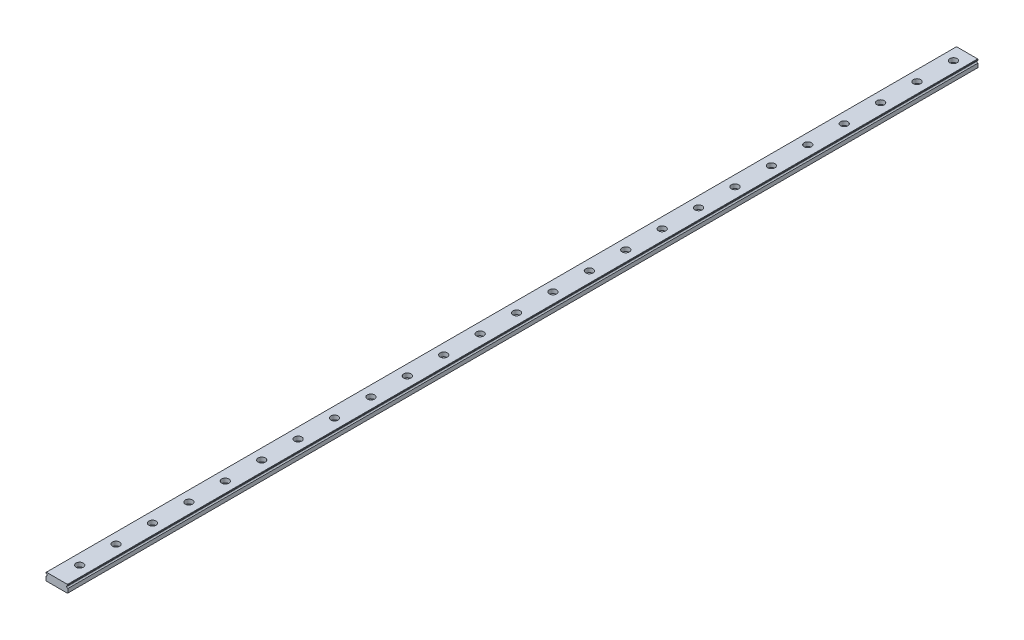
ISO-10303-21;
HEADER;
FILE_DESCRIPTION(('STEP AP214'),'2;1');
FILE_NAME('part.step','',(''),(''),'','','');
FILE_SCHEMA(('AUTOMOTIVE_DESIGN { 1 0 10303 214 1 1 1 1 }'));
ENDSEC;
DATA;
#1=APPLICATION_CONTEXT('core data for automotive mechanical design processes');
#2=APPLICATION_PROTOCOL_DEFINITION('international standard','automotive_design',2000,#1);
#3=PRODUCT_CONTEXT('',#1,'mechanical');
#4=PRODUCT('Part','Part','',(#3));
#5=PRODUCT_RELATED_PRODUCT_CATEGORY('part','',(#4));
#6=PRODUCT_DEFINITION_FORMATION('','',#4);
#7=PRODUCT_DEFINITION_CONTEXT('part definition',#1,'design');
#8=PRODUCT_DEFINITION('design','',#6,#7);
#9=PRODUCT_DEFINITION_SHAPE('','',#8);
#10=(LENGTH_UNIT() NAMED_UNIT(*) SI_UNIT(.MILLI.,.METRE.));
#11=(NAMED_UNIT(*) PLANE_ANGLE_UNIT() SI_UNIT($,.RADIAN.));
#12=(NAMED_UNIT(*) SI_UNIT($,.STERADIAN.) SOLID_ANGLE_UNIT());
#13=UNCERTAINTY_MEASURE_WITH_UNIT(LENGTH_MEASURE(1.E-05),#10,'distance_accuracy_value','');
#14=(GEOMETRIC_REPRESENTATION_CONTEXT(3) GLOBAL_UNCERTAINTY_ASSIGNED_CONTEXT((#13)) GLOBAL_UNIT_ASSIGNED_CONTEXT((#10,
#11,#12)) REPRESENTATION_CONTEXT('',''));
#15=CARTESIAN_POINT('',(0.,0.,0.));
#16=DIRECTION('',(0.,0.,1.));
#17=DIRECTION('',(1.,0.,0.));
#18=AXIS2_PLACEMENT_3D('',#15,#16,#17);
#19=CARTESIAN_POINT('',(11.6,3.40907588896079,1000.));
#20=DIRECTION('',(0.,-1.,0.));
#21=DIRECTION('',(0.,0.,-1.));
#22=AXIS2_PLACEMENT_3D('',#19,#20,#21);
#23=PLANE('',#22);
#24=CARTESIAN_POINT('',(0.,3.40907588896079,55.0000000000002));
#25=DIRECTION('',(0.,1.,0.));
#26=DIRECTION('',(0.,0.,1.));
#27=AXIS2_PLACEMENT_3D('',#24,#25,#26);
#28=CIRCLE('',#27,4.);
#29=CARTESIAN_POINT('',(0.,3.40907588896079,59.0000000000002));
#30=VERTEX_POINT('',#29);
#31=EDGE_CURVE('E777',#30,#30,#28,.T.);
#32=ORIENTED_EDGE('',*,*,#31,.F.);
#33=EDGE_LOOP('',(#32));
#34=FACE_BOUND('',#33,.T.);
#35=CARTESIAN_POINT('',(0.,3.40907588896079,175.));
#36=DIRECTION('',(0.,1.,0.));
#37=DIRECTION('',(0.,0.,1.));
#38=AXIS2_PLACEMENT_3D('',#35,#36,#37);
#39=CIRCLE('',#38,4.);
#40=CARTESIAN_POINT('',(0.,3.40907588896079,179.));
#41=VERTEX_POINT('',#40);
#42=EDGE_CURVE('E735',#41,#41,#39,.T.);
#43=ORIENTED_EDGE('',*,*,#42,.F.);
#44=EDGE_LOOP('',(#43));
#45=FACE_BOUND('',#44,.T.);
#46=CARTESIAN_POINT('',(0.,3.40907588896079,215.));
#47=DIRECTION('',(0.,1.,0.));
#48=DIRECTION('',(0.,0.,1.));
#49=AXIS2_PLACEMENT_3D('',#46,#47,#48);
#50=CIRCLE('',#49,4.);
#51=CARTESIAN_POINT('',(0.,3.40907588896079,219.));
#52=VERTEX_POINT('',#51);
#53=EDGE_CURVE('E721',#52,#52,#50,.T.);
#54=ORIENTED_EDGE('',*,*,#53,.F.);
#55=EDGE_LOOP('',(#54));
#56=FACE_BOUND('',#55,.T.);
#57=CARTESIAN_POINT('',(0.,3.40907588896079,694.999999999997));
#58=DIRECTION('',(0.,1.,0.));
#59=DIRECTION('',(0.,0.,1.));
#60=AXIS2_PLACEMENT_3D('',#57,#58,#59);
#61=CIRCLE('',#60,4.);
#62=CARTESIAN_POINT('',(0.,3.40907588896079,698.999999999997));
#63=VERTEX_POINT('',#62);
#64=EDGE_CURVE('E553',#63,#63,#61,.T.);
#65=ORIENTED_EDGE('',*,*,#64,.F.);
#66=EDGE_LOOP('',(#65));
#67=FACE_BOUND('',#66,.T.);
#68=CARTESIAN_POINT('',(0.,3.40907588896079,734.999999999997));
#69=DIRECTION('',(0.,1.,0.));
#70=DIRECTION('',(0.,0.,1.));
#71=AXIS2_PLACEMENT_3D('',#68,#69,#70);
#72=CIRCLE('',#71,4.);
#73=CARTESIAN_POINT('',(0.,3.40907588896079,738.999999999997));
#74=VERTEX_POINT('',#73);
#75=EDGE_CURVE('E539',#74,#74,#72,.T.);
#76=ORIENTED_EDGE('',*,*,#75,.F.);
#77=EDGE_LOOP('',(#76));
#78=FACE_BOUND('',#77,.T.);
#79=CARTESIAN_POINT('',(0.,3.40907588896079,774.999999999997));
#80=DIRECTION('',(0.,1.,0.));
#81=DIRECTION('',(0.,0.,1.));
#82=AXIS2_PLACEMENT_3D('',#79,#80,#81);
#83=CIRCLE('',#82,4.);
#84=CARTESIAN_POINT('',(0.,3.40907588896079,778.999999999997));
#85=VERTEX_POINT('',#84);
#86=EDGE_CURVE('E525',#85,#85,#83,.T.);
#87=ORIENTED_EDGE('',*,*,#86,.F.);
#88=EDGE_LOOP('',(#87));
#89=FACE_BOUND('',#88,.T.);
#90=CARTESIAN_POINT('',(0.,3.40907588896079,814.999999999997));
#91=DIRECTION('',(0.,1.,0.));
#92=DIRECTION('',(0.,0.,1.));
#93=AXIS2_PLACEMENT_3D('',#90,#91,#92);
#94=CIRCLE('',#93,4.);
#95=CARTESIAN_POINT('',(0.,3.40907588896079,818.999999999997));
#96=VERTEX_POINT('',#95);
#97=EDGE_CURVE('E511',#96,#96,#94,.T.);
#98=ORIENTED_EDGE('',*,*,#97,.F.);
#99=EDGE_LOOP('',(#98));
#100=FACE_BOUND('',#99,.T.);
#101=CARTESIAN_POINT('',(0.,3.40907588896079,894.999999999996));
#102=DIRECTION('',(0.,1.,0.));
#103=DIRECTION('',(0.,0.,1.));
#104=AXIS2_PLACEMENT_3D('',#101,#102,#103);
#105=CIRCLE('',#104,4.);
#106=CARTESIAN_POINT('',(0.,3.40907588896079,898.999999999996));
#107=VERTEX_POINT('',#106);
#108=EDGE_CURVE('E483',#107,#107,#105,.T.);
#109=ORIENTED_EDGE('',*,*,#108,.F.);
#110=EDGE_LOOP('',(#109));
#111=FACE_BOUND('',#110,.T.);
#112=CARTESIAN_POINT('',(0.,3.40907588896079,934.999999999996));
#113=DIRECTION('',(0.,1.,0.));
#114=DIRECTION('',(0.,0.,1.));
#115=AXIS2_PLACEMENT_3D('',#112,#113,#114);
#116=CIRCLE('',#115,4.);
#117=CARTESIAN_POINT('',(0.,3.40907588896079,938.999999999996));
#118=VERTEX_POINT('',#117);
#119=EDGE_CURVE('E469',#118,#118,#116,.T.);
#120=ORIENTED_EDGE('',*,*,#119,.F.);
#121=EDGE_LOOP('',(#120));
#122=FACE_BOUND('',#121,.T.);
#123=CARTESIAN_POINT('',(0.,3.40907588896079,974.999999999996));
#124=DIRECTION('',(0.,1.,0.));
#125=DIRECTION('',(0.,0.,1.));
#126=AXIS2_PLACEMENT_3D('',#123,#124,#125);
#127=CIRCLE('',#126,4.);
#128=CARTESIAN_POINT('',(0.,3.40907588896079,978.999999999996));
#129=VERTEX_POINT('',#128);
#130=EDGE_CURVE('E455',#129,#129,#127,.T.);
#131=ORIENTED_EDGE('',*,*,#130,.F.);
#132=EDGE_LOOP('',(#131));
#133=FACE_BOUND('',#132,.T.);
#134=CARTESIAN_POINT('',(0.,3.40907588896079,15.));
#135=DIRECTION('',(0.,1.,0.));
#136=DIRECTION('',(0.,0.,1.));
#137=AXIS2_PLACEMENT_3D('',#134,#135,#136);
#138=CIRCLE('',#137,4.);
#139=CARTESIAN_POINT('',(0.,3.40907588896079,19.));
#140=VERTEX_POINT('',#139);
#141=EDGE_CURVE('E441',#140,#140,#138,.T.);
#142=ORIENTED_EDGE('',*,*,#141,.F.);
#143=EDGE_LOOP('',(#142));
#144=FACE_BOUND('',#143,.T.);
#145=DIRECTION('',(-1.,0.,0.));
#146=VECTOR('',#145,1.);
#147=CARTESIAN_POINT('',(11.6,3.40907588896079,0.));
#148=LINE('',#147,#146);
#149=CARTESIAN_POINT('',(11.6,3.40907588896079,0.));
#150=VERTEX_POINT('',#149);
#151=CARTESIAN_POINT('',(-11.6,3.40907588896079,0.));
#152=VERTEX_POINT('',#151);
#153=EDGE_CURVE('E194',#150,#152,#148,.T.);
#154=ORIENTED_EDGE('',*,*,#153,.T.);
#155=DIRECTION('',(0.,0.,-1.));
#156=VECTOR('',#155,1.);
#157=CARTESIAN_POINT('',(-11.6,3.40907588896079,1000.));
#158=LINE('',#157,#156);
#159=CARTESIAN_POINT('',(-11.6,3.40907588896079,1000.));
#160=VERTEX_POINT('',#159);
#161=EDGE_CURVE('E214',#160,#152,#158,.T.);
#162=ORIENTED_EDGE('',*,*,#161,.F.);
#163=DIRECTION('',(-1.,0.,0.));
#164=VECTOR('',#163,1.);
#165=CARTESIAN_POINT('',(11.6,3.40907588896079,1000.));
#166=LINE('',#165,#164);
#167=CARTESIAN_POINT('',(11.6,3.40907588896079,1000.));
#168=VERTEX_POINT('',#167);
#169=EDGE_CURVE('E271',#168,#160,#166,.T.);
#170=ORIENTED_EDGE('',*,*,#169,.F.);
#171=DIRECTION('',(0.,0.,-1.));
#172=VECTOR('',#171,1.);
#173=CARTESIAN_POINT('',(11.6,3.40907588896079,1000.));
#174=LINE('',#173,#172);
#175=EDGE_CURVE('E218',#168,#150,#174,.T.);
#176=ORIENTED_EDGE('',*,*,#175,.T.);
#177=EDGE_LOOP('',(#154,#162,#170,#176));
#178=FACE_BOUND('',#177,.T.);
#179=CARTESIAN_POINT('',(0.,3.40907588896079,854.999999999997));
#180=DIRECTION('',(0.,1.,0.));
#181=DIRECTION('',(0.,0.,1.));
#182=AXIS2_PLACEMENT_3D('',#179,#180,#181);
#183=CIRCLE('',#182,4.);
#184=CARTESIAN_POINT('',(0.,3.40907588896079,858.999999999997));
#185=VERTEX_POINT('',#184);
#186=EDGE_CURVE('E497',#185,#185,#183,.T.);
#187=ORIENTED_EDGE('',*,*,#186,.F.);
#188=EDGE_LOOP('',(#187));
#189=FACE_BOUND('',#188,.T.);
#190=CARTESIAN_POINT('',(0.,3.40907588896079,654.999999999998));
#191=DIRECTION('',(0.,1.,0.));
#192=DIRECTION('',(0.,0.,1.));
#193=AXIS2_PLACEMENT_3D('',#190,#191,#192);
#194=CIRCLE('',#193,4.);
#195=CARTESIAN_POINT('',(0.,3.40907588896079,658.999999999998));
#196=VERTEX_POINT('',#195);
#197=EDGE_CURVE('E567',#196,#196,#194,.T.);
#198=ORIENTED_EDGE('',*,*,#197,.F.);
#199=EDGE_LOOP('',(#198));
#200=FACE_BOUND('',#199,.T.);
#201=CARTESIAN_POINT('',(0.,3.40907588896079,614.999999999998));
#202=DIRECTION('',(0.,1.,0.));
#203=DIRECTION('',(0.,0.,1.));
#204=AXIS2_PLACEMENT_3D('',#201,#202,#203);
#205=CIRCLE('',#204,4.);
#206=CARTESIAN_POINT('',(0.,3.40907588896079,618.999999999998));
#207=VERTEX_POINT('',#206);
#208=EDGE_CURVE('E581',#207,#207,#205,.T.);
#209=ORIENTED_EDGE('',*,*,#208,.F.);
#210=EDGE_LOOP('',(#209));
#211=FACE_BOUND('',#210,.T.);
#212=CARTESIAN_POINT('',(0.,3.40907588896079,574.999999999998));
#213=DIRECTION('',(0.,1.,0.));
#214=DIRECTION('',(0.,0.,1.));
#215=AXIS2_PLACEMENT_3D('',#212,#213,#214);
#216=CIRCLE('',#215,4.);
#217=CARTESIAN_POINT('',(0.,3.40907588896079,578.999999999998));
#218=VERTEX_POINT('',#217);
#219=EDGE_CURVE('E595',#218,#218,#216,.T.);
#220=ORIENTED_EDGE('',*,*,#219,.F.);
#221=EDGE_LOOP('',(#220));
#222=FACE_BOUND('',#221,.T.);
#223=CARTESIAN_POINT('',(0.,3.40907588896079,534.999999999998));
#224=DIRECTION('',(0.,1.,0.));
#225=DIRECTION('',(0.,0.,1.));
#226=AXIS2_PLACEMENT_3D('',#223,#224,#225);
#227=CIRCLE('',#226,4.);
#228=CARTESIAN_POINT('',(0.,3.40907588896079,538.999999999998));
#229=VERTEX_POINT('',#228);
#230=EDGE_CURVE('E609',#229,#229,#227,.T.);
#231=ORIENTED_EDGE('',*,*,#230,.F.);
#232=EDGE_LOOP('',(#231));
#233=FACE_BOUND('',#232,.T.);
#234=CARTESIAN_POINT('',(0.,3.40907588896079,494.999999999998));
#235=DIRECTION('',(0.,1.,0.));
#236=DIRECTION('',(0.,0.,1.));
#237=AXIS2_PLACEMENT_3D('',#234,#235,#236);
#238=CIRCLE('',#237,4.);
#239=CARTESIAN_POINT('',(0.,3.40907588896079,498.999999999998));
#240=VERTEX_POINT('',#239);
#241=EDGE_CURVE('E623',#240,#240,#238,.T.);
#242=ORIENTED_EDGE('',*,*,#241,.F.);
#243=EDGE_LOOP('',(#242));
#244=FACE_BOUND('',#243,.T.);
#245=CARTESIAN_POINT('',(0.,3.40907588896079,454.999999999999));
#246=DIRECTION('',(0.,1.,0.));
#247=DIRECTION('',(0.,0.,1.));
#248=AXIS2_PLACEMENT_3D('',#245,#246,#247);
#249=CIRCLE('',#248,4.);
#250=CARTESIAN_POINT('',(0.,3.40907588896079,458.999999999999));
#251=VERTEX_POINT('',#250);
#252=EDGE_CURVE('E637',#251,#251,#249,.T.);
#253=ORIENTED_EDGE('',*,*,#252,.F.);
#254=EDGE_LOOP('',(#253));
#255=FACE_BOUND('',#254,.T.);
#256=CARTESIAN_POINT('',(0.,3.40907588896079,414.999999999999));
#257=DIRECTION('',(0.,1.,0.));
#258=DIRECTION('',(0.,0.,1.));
#259=AXIS2_PLACEMENT_3D('',#256,#257,#258);
#260=CIRCLE('',#259,4.);
#261=CARTESIAN_POINT('',(0.,3.40907588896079,418.999999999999));
#262=VERTEX_POINT('',#261);
#263=EDGE_CURVE('E651',#262,#262,#260,.T.);
#264=ORIENTED_EDGE('',*,*,#263,.F.);
#265=EDGE_LOOP('',(#264));
#266=FACE_BOUND('',#265,.T.);
#267=CARTESIAN_POINT('',(0.,3.40907588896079,374.999999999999));
#268=DIRECTION('',(0.,1.,0.));
#269=DIRECTION('',(0.,0.,1.));
#270=AXIS2_PLACEMENT_3D('',#267,#268,#269);
#271=CIRCLE('',#270,4.);
#272=CARTESIAN_POINT('',(0.,3.40907588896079,378.999999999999));
#273=VERTEX_POINT('',#272);
#274=EDGE_CURVE('E665',#273,#273,#271,.T.);
#275=ORIENTED_EDGE('',*,*,#274,.F.);
#276=EDGE_LOOP('',(#275));
#277=FACE_BOUND('',#276,.T.);
#278=CARTESIAN_POINT('',(0.,3.40907588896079,334.999999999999));
#279=DIRECTION('',(0.,1.,0.));
#280=DIRECTION('',(0.,0.,1.));
#281=AXIS2_PLACEMENT_3D('',#278,#279,#280);
#282=CIRCLE('',#281,4.);
#283=CARTESIAN_POINT('',(0.,3.40907588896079,338.999999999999));
#284=VERTEX_POINT('',#283);
#285=EDGE_CURVE('E679',#284,#284,#282,.T.);
#286=ORIENTED_EDGE('',*,*,#285,.F.);
#287=EDGE_LOOP('',(#286));
#288=FACE_BOUND('',#287,.T.);
#289=CARTESIAN_POINT('',(0.,3.40907588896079,294.999999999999));
#290=DIRECTION('',(0.,1.,0.));
#291=DIRECTION('',(0.,0.,1.));
#292=AXIS2_PLACEMENT_3D('',#289,#290,#291);
#293=CIRCLE('',#292,4.);
#294=CARTESIAN_POINT('',(0.,3.40907588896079,298.999999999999));
#295=VERTEX_POINT('',#294);
#296=EDGE_CURVE('E693',#295,#295,#293,.T.);
#297=ORIENTED_EDGE('',*,*,#296,.F.);
#298=EDGE_LOOP('',(#297));
#299=FACE_BOUND('',#298,.T.);
#300=CARTESIAN_POINT('',(0.,3.40907588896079,254.999999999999));
#301=DIRECTION('',(0.,1.,0.));
#302=DIRECTION('',(0.,0.,1.));
#303=AXIS2_PLACEMENT_3D('',#300,#301,#302);
#304=CIRCLE('',#303,4.);
#305=CARTESIAN_POINT('',(0.,3.40907588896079,258.999999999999));
#306=VERTEX_POINT('',#305);
#307=EDGE_CURVE('E707',#306,#306,#304,.T.);
#308=ORIENTED_EDGE('',*,*,#307,.F.);
#309=EDGE_LOOP('',(#308));
#310=FACE_BOUND('',#309,.T.);
#311=CARTESIAN_POINT('',(0.,3.40907588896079,135.));
#312=DIRECTION('',(0.,1.,0.));
#313=DIRECTION('',(0.,0.,1.));
#314=AXIS2_PLACEMENT_3D('',#311,#312,#313);
#315=CIRCLE('',#314,4.);
#316=CARTESIAN_POINT('',(0.,3.40907588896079,139.));
#317=VERTEX_POINT('',#316);
#318=EDGE_CURVE('E749',#317,#317,#315,.T.);
#319=ORIENTED_EDGE('',*,*,#318,.F.);
#320=EDGE_LOOP('',(#319));
#321=FACE_BOUND('',#320,.T.);
#322=CARTESIAN_POINT('',(0.,3.40907588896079,95.0000000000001));
#323=DIRECTION('',(0.,1.,0.));
#324=DIRECTION('',(0.,0.,1.));
#325=AXIS2_PLACEMENT_3D('',#322,#323,#324);
#326=CIRCLE('',#325,4.);
#327=CARTESIAN_POINT('',(0.,3.40907588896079,99.0000000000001));
#328=VERTEX_POINT('',#327);
#329=EDGE_CURVE('E763',#328,#328,#326,.T.);
#330=ORIENTED_EDGE('',*,*,#329,.F.);
#331=EDGE_LOOP('',(#330));
#332=FACE_BOUND('',#331,.T.);
#333=ADVANCED_FACE('F45',(#34,#45,#56,#67,#78,#89,#100,#111,#122,#133,#144,#178,#189,#200,#211,
#222,#233,#244,#255,#266,#277,#288,#299,#310,#321,#332),#23,.F.);
#334=CARTESIAN_POINT('',(-12.,-4.69092411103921,1000.));
#335=DIRECTION('',(0.707106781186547,0.707106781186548,0.));
#336=DIRECTION('',(-0.707106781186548,0.707106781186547,0.));
#337=AXIS2_PLACEMENT_3D('',#334,#335,#336);
#338=PLANE('',#337);
#339=DIRECTION('',(0.707106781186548,-0.707106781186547,0.));
#340=VECTOR('',#339,1.);
#341=CARTESIAN_POINT('',(-12.,-4.69092411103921,0.));
#342=LINE('',#341,#340);
#343=CARTESIAN_POINT('',(-12.,-4.69092411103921,0.));
#344=VERTEX_POINT('',#343);
#345=CARTESIAN_POINT('',(-11.6,-5.09092411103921,0.));
#346=VERTEX_POINT('',#345);
#347=EDGE_CURVE('E170',#344,#346,#342,.T.);
#348=ORIENTED_EDGE('',*,*,#347,.T.);
#349=DIRECTION('',(0.,0.,-1.));
#350=VECTOR('',#349,1.);
#351=CARTESIAN_POINT('',(-11.6,-5.09092411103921,1000.));
#352=LINE('',#351,#350);
#353=CARTESIAN_POINT('',(-11.6,-5.09092411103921,1000.));
#354=VERTEX_POINT('',#353);
#355=EDGE_CURVE('E12',#354,#346,#352,.T.);
#356=ORIENTED_EDGE('',*,*,#355,.F.);
#357=DIRECTION('',(0.707106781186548,-0.707106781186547,0.));
#358=VECTOR('',#357,1.);
#359=CARTESIAN_POINT('',(-12.,-4.69092411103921,1000.));
#360=LINE('',#359,#358);
#361=CARTESIAN_POINT('',(-12.,-4.69092411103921,1000.));
#362=VERTEX_POINT('',#361);
#363=EDGE_CURVE('E207',#362,#354,#360,.T.);
#364=ORIENTED_EDGE('',*,*,#363,.F.);
#365=DIRECTION('',(0.,0.,-1.));
#366=VECTOR('',#365,1.);
#367=CARTESIAN_POINT('',(-12.,-4.69092411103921,1000.));
#368=LINE('',#367,#366);
#369=EDGE_CURVE('E166',#362,#344,#368,.T.);
#370=ORIENTED_EDGE('',*,*,#369,.T.);
#371=EDGE_LOOP('',(#348,#356,#364,#370));
#372=FACE_BOUND('',#371,.T.);
#373=ADVANCED_FACE('F47',(#372),#338,.F.);
#374=CARTESIAN_POINT('',(6.3,-5.09092411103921,1000.));
#375=DIRECTION('',(0.,1.,0.));
#376=DIRECTION('',(0.,0.,1.));
#377=AXIS2_PLACEMENT_3D('',#374,#375,#376);
#378=PLANE('',#377);
#379=CARTESIAN_POINT('',(0.,-5.09092411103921,55.0000000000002));
#380=DIRECTION('',(0.,1.,0.));
#381=DIRECTION('',(0.,0.,1.));
#382=AXIS2_PLACEMENT_3D('',#379,#380,#381);
#383=CIRCLE('',#382,2.25);
#384=CARTESIAN_POINT('',(0.,-5.09092411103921,57.2500000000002));
#385=VERTEX_POINT('',#384);
#386=EDGE_CURVE('E331',#385,#385,#383,.T.);
#387=ORIENTED_EDGE('',*,*,#386,.T.);
#388=EDGE_LOOP('',(#387));
#389=FACE_BOUND('',#388,.T.);
#390=CARTESIAN_POINT('',(0.,-5.09092411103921,95.0000000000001));
#391=DIRECTION('',(0.,1.,0.));
#392=DIRECTION('',(0.,0.,1.));
#393=AXIS2_PLACEMENT_3D('',#390,#391,#392);
#394=CIRCLE('',#393,2.25);
#395=CARTESIAN_POINT('',(0.,-5.09092411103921,97.2500000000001));
#396=VERTEX_POINT('',#395);
#397=EDGE_CURVE('E335',#396,#396,#394,.T.);
#398=ORIENTED_EDGE('',*,*,#397,.T.);
#399=EDGE_LOOP('',(#398));
#400=FACE_BOUND('',#399,.T.);
#401=CARTESIAN_POINT('',(0.,-5.09092411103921,135.));
#402=DIRECTION('',(0.,1.,0.));
#403=DIRECTION('',(0.,0.,1.));
#404=AXIS2_PLACEMENT_3D('',#401,#402,#403);
#405=CIRCLE('',#404,2.25);
#406=CARTESIAN_POINT('',(0.,-5.09092411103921,137.25));
#407=VERTEX_POINT('',#406);
#408=EDGE_CURVE('E339',#407,#407,#405,.T.);
#409=ORIENTED_EDGE('',*,*,#408,.T.);
#410=EDGE_LOOP('',(#409));
#411=FACE_BOUND('',#410,.T.);
#412=CARTESIAN_POINT('',(0.,-5.09092411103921,175.));
#413=DIRECTION('',(0.,1.,0.));
#414=DIRECTION('',(0.,0.,1.));
#415=AXIS2_PLACEMENT_3D('',#412,#413,#414);
#416=CIRCLE('',#415,2.25);
#417=CARTESIAN_POINT('',(0.,-5.09092411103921,177.25));
#418=VERTEX_POINT('',#417);
#419=EDGE_CURVE('E343',#418,#418,#416,.T.);
#420=ORIENTED_EDGE('',*,*,#419,.T.);
#421=EDGE_LOOP('',(#420));
#422=FACE_BOUND('',#421,.T.);
#423=CARTESIAN_POINT('',(0.,-5.09092411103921,215.));
#424=DIRECTION('',(0.,1.,0.));
#425=DIRECTION('',(0.,0.,1.));
#426=AXIS2_PLACEMENT_3D('',#423,#424,#425);
#427=CIRCLE('',#426,2.25);
#428=CARTESIAN_POINT('',(0.,-5.09092411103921,217.25));
#429=VERTEX_POINT('',#428);
#430=EDGE_CURVE('E347',#429,#429,#427,.T.);
#431=ORIENTED_EDGE('',*,*,#430,.T.);
#432=EDGE_LOOP('',(#431));
#433=FACE_BOUND('',#432,.T.);
#434=CARTESIAN_POINT('',(0.,-5.09092411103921,254.999999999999));
#435=DIRECTION('',(0.,1.,0.));
#436=DIRECTION('',(0.,0.,1.));
#437=AXIS2_PLACEMENT_3D('',#434,#435,#436);
#438=CIRCLE('',#437,2.25);
#439=CARTESIAN_POINT('',(0.,-5.09092411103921,257.249999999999));
#440=VERTEX_POINT('',#439);
#441=EDGE_CURVE('E351',#440,#440,#438,.T.);
#442=ORIENTED_EDGE('',*,*,#441,.T.);
#443=EDGE_LOOP('',(#442));
#444=FACE_BOUND('',#443,.T.);
#445=CARTESIAN_POINT('',(0.,-5.09092411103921,294.999999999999));
#446=DIRECTION('',(0.,1.,0.));
#447=DIRECTION('',(0.,0.,1.));
#448=AXIS2_PLACEMENT_3D('',#445,#446,#447);
#449=CIRCLE('',#448,2.25);
#450=CARTESIAN_POINT('',(0.,-5.09092411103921,297.249999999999));
#451=VERTEX_POINT('',#450);
#452=EDGE_CURVE('E355',#451,#451,#449,.T.);
#453=ORIENTED_EDGE('',*,*,#452,.T.);
#454=EDGE_LOOP('',(#453));
#455=FACE_BOUND('',#454,.T.);
#456=CARTESIAN_POINT('',(0.,-5.09092411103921,334.999999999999));
#457=DIRECTION('',(0.,1.,0.));
#458=DIRECTION('',(0.,0.,1.));
#459=AXIS2_PLACEMENT_3D('',#456,#457,#458);
#460=CIRCLE('',#459,2.25);
#461=CARTESIAN_POINT('',(0.,-5.09092411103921,337.249999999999));
#462=VERTEX_POINT('',#461);
#463=EDGE_CURVE('E359',#462,#462,#460,.T.);
#464=ORIENTED_EDGE('',*,*,#463,.T.);
#465=EDGE_LOOP('',(#464));
#466=FACE_BOUND('',#465,.T.);
#467=CARTESIAN_POINT('',(0.,-5.09092411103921,374.999999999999));
#468=DIRECTION('',(0.,1.,0.));
#469=DIRECTION('',(0.,0.,1.));
#470=AXIS2_PLACEMENT_3D('',#467,#468,#469);
#471=CIRCLE('',#470,2.25);
#472=CARTESIAN_POINT('',(0.,-5.09092411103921,377.249999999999));
#473=VERTEX_POINT('',#472);
#474=EDGE_CURVE('E363',#473,#473,#471,.T.);
#475=ORIENTED_EDGE('',*,*,#474,.T.);
#476=EDGE_LOOP('',(#475));
#477=FACE_BOUND('',#476,.T.);
#478=CARTESIAN_POINT('',(0.,-5.09092411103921,414.999999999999));
#479=DIRECTION('',(0.,1.,0.));
#480=DIRECTION('',(0.,0.,1.));
#481=AXIS2_PLACEMENT_3D('',#478,#479,#480);
#482=CIRCLE('',#481,2.25);
#483=CARTESIAN_POINT('',(0.,-5.09092411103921,417.249999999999));
#484=VERTEX_POINT('',#483);
#485=EDGE_CURVE('E367',#484,#484,#482,.T.);
#486=ORIENTED_EDGE('',*,*,#485,.T.);
#487=EDGE_LOOP('',(#486));
#488=FACE_BOUND('',#487,.T.);
#489=CARTESIAN_POINT('',(0.,-5.09092411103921,454.999999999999));
#490=DIRECTION('',(0.,1.,0.));
#491=DIRECTION('',(0.,0.,1.));
#492=AXIS2_PLACEMENT_3D('',#489,#490,#491);
#493=CIRCLE('',#492,2.25);
#494=CARTESIAN_POINT('',(0.,-5.09092411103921,457.249999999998));
#495=VERTEX_POINT('',#494);
#496=EDGE_CURVE('E371',#495,#495,#493,.T.);
#497=ORIENTED_EDGE('',*,*,#496,.T.);
#498=EDGE_LOOP('',(#497));
#499=FACE_BOUND('',#498,.T.);
#500=CARTESIAN_POINT('',(0.,-5.09092411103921,494.999999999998));
#501=DIRECTION('',(0.,1.,0.));
#502=DIRECTION('',(0.,0.,1.));
#503=AXIS2_PLACEMENT_3D('',#500,#501,#502);
#504=CIRCLE('',#503,2.25);
#505=CARTESIAN_POINT('',(0.,-5.09092411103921,497.249999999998));
#506=VERTEX_POINT('',#505);
#507=EDGE_CURVE('E375',#506,#506,#504,.T.);
#508=ORIENTED_EDGE('',*,*,#507,.T.);
#509=EDGE_LOOP('',(#508));
#510=FACE_BOUND('',#509,.T.);
#511=CARTESIAN_POINT('',(0.,-5.09092411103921,534.999999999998));
#512=DIRECTION('',(0.,1.,0.));
#513=DIRECTION('',(0.,0.,1.));
#514=AXIS2_PLACEMENT_3D('',#511,#512,#513);
#515=CIRCLE('',#514,2.25);
#516=CARTESIAN_POINT('',(0.,-5.09092411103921,537.249999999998));
#517=VERTEX_POINT('',#516);
#518=EDGE_CURVE('E379',#517,#517,#515,.T.);
#519=ORIENTED_EDGE('',*,*,#518,.T.);
#520=EDGE_LOOP('',(#519));
#521=FACE_BOUND('',#520,.T.);
#522=CARTESIAN_POINT('',(0.,-5.09092411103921,574.999999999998));
#523=DIRECTION('',(0.,1.,0.));
#524=DIRECTION('',(0.,0.,1.));
#525=AXIS2_PLACEMENT_3D('',#522,#523,#524);
#526=CIRCLE('',#525,2.25);
#527=CARTESIAN_POINT('',(0.,-5.09092411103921,577.249999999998));
#528=VERTEX_POINT('',#527);
#529=EDGE_CURVE('E383',#528,#528,#526,.T.);
#530=ORIENTED_EDGE('',*,*,#529,.T.);
#531=EDGE_LOOP('',(#530));
#532=FACE_BOUND('',#531,.T.);
#533=CARTESIAN_POINT('',(0.,-5.09092411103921,614.999999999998));
#534=DIRECTION('',(0.,1.,0.));
#535=DIRECTION('',(0.,0.,1.));
#536=AXIS2_PLACEMENT_3D('',#533,#534,#535);
#537=CIRCLE('',#536,2.25);
#538=CARTESIAN_POINT('',(0.,-5.09092411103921,617.249999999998));
#539=VERTEX_POINT('',#538);
#540=EDGE_CURVE('E387',#539,#539,#537,.T.);
#541=ORIENTED_EDGE('',*,*,#540,.T.);
#542=EDGE_LOOP('',(#541));
#543=FACE_BOUND('',#542,.T.);
#544=CARTESIAN_POINT('',(0.,-5.09092411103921,654.999999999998));
#545=DIRECTION('',(0.,1.,0.));
#546=DIRECTION('',(0.,0.,1.));
#547=AXIS2_PLACEMENT_3D('',#544,#545,#546);
#548=CIRCLE('',#547,2.25);
#549=CARTESIAN_POINT('',(0.,-5.09092411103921,657.249999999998));
#550=VERTEX_POINT('',#549);
#551=EDGE_CURVE('E391',#550,#550,#548,.T.);
#552=ORIENTED_EDGE('',*,*,#551,.T.);
#553=EDGE_LOOP('',(#552));
#554=FACE_BOUND('',#553,.T.);
#555=CARTESIAN_POINT('',(0.,-5.09092411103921,694.999999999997));
#556=DIRECTION('',(0.,1.,0.));
#557=DIRECTION('',(0.,0.,1.));
#558=AXIS2_PLACEMENT_3D('',#555,#556,#557);
#559=CIRCLE('',#558,2.25);
#560=CARTESIAN_POINT('',(0.,-5.09092411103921,697.249999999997));
#561=VERTEX_POINT('',#560);
#562=EDGE_CURVE('E395',#561,#561,#559,.T.);
#563=ORIENTED_EDGE('',*,*,#562,.T.);
#564=EDGE_LOOP('',(#563));
#565=FACE_BOUND('',#564,.T.);
#566=CARTESIAN_POINT('',(0.,-5.09092411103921,734.999999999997));
#567=DIRECTION('',(0.,1.,0.));
#568=DIRECTION('',(0.,0.,1.));
#569=AXIS2_PLACEMENT_3D('',#566,#567,#568);
#570=CIRCLE('',#569,2.25);
#571=CARTESIAN_POINT('',(0.,-5.09092411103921,737.249999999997));
#572=VERTEX_POINT('',#571);
#573=EDGE_CURVE('E399',#572,#572,#570,.T.);
#574=ORIENTED_EDGE('',*,*,#573,.T.);
#575=EDGE_LOOP('',(#574));
#576=FACE_BOUND('',#575,.T.);
#577=CARTESIAN_POINT('',(0.,-5.09092411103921,774.999999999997));
#578=DIRECTION('',(0.,1.,0.));
#579=DIRECTION('',(0.,0.,1.));
#580=AXIS2_PLACEMENT_3D('',#577,#578,#579);
#581=CIRCLE('',#580,2.25);
#582=CARTESIAN_POINT('',(0.,-5.09092411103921,777.249999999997));
#583=VERTEX_POINT('',#582);
#584=EDGE_CURVE('E403',#583,#583,#581,.T.);
#585=ORIENTED_EDGE('',*,*,#584,.T.);
#586=EDGE_LOOP('',(#585));
#587=FACE_BOUND('',#586,.T.);
#588=CARTESIAN_POINT('',(0.,-5.09092411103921,814.999999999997));
#589=DIRECTION('',(0.,1.,0.));
#590=DIRECTION('',(0.,0.,1.));
#591=AXIS2_PLACEMENT_3D('',#588,#589,#590);
#592=CIRCLE('',#591,2.25);
#593=CARTESIAN_POINT('',(0.,-5.09092411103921,817.249999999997));
#594=VERTEX_POINT('',#593);
#595=EDGE_CURVE('E407',#594,#594,#592,.T.);
#596=ORIENTED_EDGE('',*,*,#595,.T.);
#597=EDGE_LOOP('',(#596));
#598=FACE_BOUND('',#597,.T.);
#599=CARTESIAN_POINT('',(0.,-5.09092411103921,854.999999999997));
#600=DIRECTION('',(0.,1.,0.));
#601=DIRECTION('',(0.,0.,1.));
#602=AXIS2_PLACEMENT_3D('',#599,#600,#601);
#603=CIRCLE('',#602,2.25);
#604=CARTESIAN_POINT('',(0.,-5.09092411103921,857.249999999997));
#605=VERTEX_POINT('',#604);
#606=EDGE_CURVE('E411',#605,#605,#603,.T.);
#607=ORIENTED_EDGE('',*,*,#606,.T.);
#608=EDGE_LOOP('',(#607));
#609=FACE_BOUND('',#608,.T.);
#610=CARTESIAN_POINT('',(0.,-5.09092411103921,894.999999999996));
#611=DIRECTION('',(0.,1.,0.));
#612=DIRECTION('',(0.,0.,1.));
#613=AXIS2_PLACEMENT_3D('',#610,#611,#612);
#614=CIRCLE('',#613,2.25);
#615=CARTESIAN_POINT('',(0.,-5.09092411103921,897.249999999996));
#616=VERTEX_POINT('',#615);
#617=EDGE_CURVE('E415',#616,#616,#614,.T.);
#618=ORIENTED_EDGE('',*,*,#617,.T.);
#619=EDGE_LOOP('',(#618));
#620=FACE_BOUND('',#619,.T.);
#621=CARTESIAN_POINT('',(0.,-5.09092411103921,934.999999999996));
#622=DIRECTION('',(0.,1.,0.));
#623=DIRECTION('',(0.,0.,1.));
#624=AXIS2_PLACEMENT_3D('',#621,#622,#623);
#625=CIRCLE('',#624,2.25);
#626=CARTESIAN_POINT('',(0.,-5.09092411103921,937.249999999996));
#627=VERTEX_POINT('',#626);
#628=EDGE_CURVE('E419',#627,#627,#625,.T.);
#629=ORIENTED_EDGE('',*,*,#628,.T.);
#630=EDGE_LOOP('',(#629));
#631=FACE_BOUND('',#630,.T.);
#632=CARTESIAN_POINT('',(0.,-5.09092411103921,974.999999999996));
#633=DIRECTION('',(0.,1.,0.));
#634=DIRECTION('',(0.,0.,1.));
#635=AXIS2_PLACEMENT_3D('',#632,#633,#634);
#636=CIRCLE('',#635,2.25);
#637=CARTESIAN_POINT('',(0.,-5.09092411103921,977.249999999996));
#638=VERTEX_POINT('',#637);
#639=EDGE_CURVE('E423',#638,#638,#636,.T.);
#640=ORIENTED_EDGE('',*,*,#639,.T.);
#641=EDGE_LOOP('',(#640));
#642=FACE_BOUND('',#641,.T.);
#643=CARTESIAN_POINT('',(0.,-5.09092411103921,15.));
#644=DIRECTION('',(0.,1.,0.));
#645=DIRECTION('',(0.,0.,1.));
#646=AXIS2_PLACEMENT_3D('',#643,#644,#645);
#647=CIRCLE('',#646,2.25);
#648=CARTESIAN_POINT('',(0.,-5.09092411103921,17.25));
#649=VERTEX_POINT('',#648);
#650=EDGE_CURVE('E175',#649,#649,#647,.T.);
#651=ORIENTED_EDGE('',*,*,#650,.T.);
#652=EDGE_LOOP('',(#651));
#653=FACE_BOUND('',#652,.T.);
#654=DIRECTION('',(1.,0.,0.));
#655=VECTOR('',#654,1.);
#656=CARTESIAN_POINT('',(6.3,-5.09092411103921,0.));
#657=LINE('',#656,#655);
#658=CARTESIAN_POINT('',(11.6,-5.09092411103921,0.));
#659=VERTEX_POINT('',#658);
#660=EDGE_CURVE('E174',#346,#659,#657,.T.);
#661=ORIENTED_EDGE('',*,*,#660,.T.);
#662=DIRECTION('',(0.,0.,-1.));
#663=VECTOR('',#662,1.);
#664=CARTESIAN_POINT('',(11.6,-5.09092411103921,1000.));
#665=LINE('',#664,#663);
#666=CARTESIAN_POINT('',(11.6,-5.09092411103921,1000.));
#667=VERTEX_POINT('',#666);
#668=EDGE_CURVE('E55',#667,#659,#665,.T.);
#669=ORIENTED_EDGE('',*,*,#668,.F.);
#670=DIRECTION('',(1.,0.,0.));
#671=VECTOR('',#670,1.);
#672=CARTESIAN_POINT('',(-11.6,-5.09092411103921,1000.));
#673=LINE('',#672,#671);
#674=EDGE_CURVE('E114',#354,#667,#673,.T.);
#675=ORIENTED_EDGE('',*,*,#674,.F.);
#676=ORIENTED_EDGE('',*,*,#355,.T.);
#677=EDGE_LOOP('',(#661,#669,#675,#676));
#678=FACE_BOUND('',#677,.T.);
#679=ADVANCED_FACE('F303',(#389,#400,#411,#422,#433,#444,#455,#466,#477,#488,#499,#510,#521,
#532,#543,#554,#565,#576,#587,#598,#609,#620,#631,#642,#653,#678),#378,.F.);
#680=CARTESIAN_POINT('',(11.6,-5.09092411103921,1000.));
#681=DIRECTION('',(-0.707106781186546,0.707106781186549,0.));
#682=DIRECTION('',(-0.707106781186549,-0.707106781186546,0.));
#683=AXIS2_PLACEMENT_3D('',#680,#681,#682);
#684=PLANE('',#683);
#685=DIRECTION('',(0.707106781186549,0.707106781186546,0.));
#686=VECTOR('',#685,1.);
#687=CARTESIAN_POINT('',(11.6,-5.09092411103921,0.));
#688=LINE('',#687,#686);
#689=CARTESIAN_POINT('',(12.,-4.69092411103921,0.));
#690=VERTEX_POINT('',#689);
#691=EDGE_CURVE('E178',#659,#690,#688,.T.);
#692=ORIENTED_EDGE('',*,*,#691,.T.);
#693=DIRECTION('',(0.,0.,-1.));
#694=VECTOR('',#693,1.);
#695=CARTESIAN_POINT('',(12.,-4.69092411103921,1000.));
#696=LINE('',#695,#694);
#697=CARTESIAN_POINT('',(12.,-4.69092411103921,1000.));
#698=VERTEX_POINT('',#697);
#699=EDGE_CURVE('E233',#698,#690,#696,.T.);
#700=ORIENTED_EDGE('',*,*,#699,.F.);
#701=DIRECTION('',(0.707106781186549,0.707106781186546,0.));
#702=VECTOR('',#701,1.);
#703=CARTESIAN_POINT('',(11.6,-5.09092411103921,1000.));
#704=LINE('',#703,#702);
#705=EDGE_CURVE('E243',#667,#698,#704,.T.);
#706=ORIENTED_EDGE('',*,*,#705,.F.);
#707=ORIENTED_EDGE('',*,*,#668,.T.);
#708=EDGE_LOOP('',(#692,#700,#706,#707));
#709=FACE_BOUND('',#708,.T.);
#710=ADVANCED_FACE('F241',(#709),#684,.F.);
#711=CARTESIAN_POINT('',(12.,-4.69092411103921,1000.));
#712=DIRECTION('',(-1.,0.,0.));
#713=DIRECTION('',(0.,0.,1.));
#714=AXIS2_PLACEMENT_3D('',#711,#712,#713);
#715=PLANE('',#714);
#716=DIRECTION('',(0.,1.,0.));
#717=VECTOR('',#716,1.);
#718=CARTESIAN_POINT('',(12.,-4.69092411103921,0.));
#719=LINE('',#718,#717);
#720=CARTESIAN_POINT('',(12.,-0.340924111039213,0.));
#721=VERTEX_POINT('',#720);
#722=EDGE_CURVE('E181',#690,#721,#719,.T.);
#723=ORIENTED_EDGE('',*,*,#722,.T.);
#724=DIRECTION('',(0.,0.,-1.));
#725=VECTOR('',#724,1.);
#726=CARTESIAN_POINT('',(12.,-0.340924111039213,1000.));
#727=LINE('',#726,#725);
#728=CARTESIAN_POINT('',(12.,-0.340924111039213,1000.));
#729=VERTEX_POINT('',#728);
#730=EDGE_CURVE('E229',#729,#721,#727,.T.);
#731=ORIENTED_EDGE('',*,*,#730,.F.);
#732=DIRECTION('',(0.,1.,0.));
#733=VECTOR('',#732,1.);
#734=CARTESIAN_POINT('',(12.,-4.69092411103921,1000.));
#735=LINE('',#734,#733);
#736=EDGE_CURVE('E255',#698,#729,#735,.T.);
#737=ORIENTED_EDGE('',*,*,#736,.F.);
#738=ORIENTED_EDGE('',*,*,#699,.T.);
#739=EDGE_LOOP('',(#723,#731,#737,#738));
#740=FACE_BOUND('',#739,.T.);
#741=ADVANCED_FACE('F252',(#740),#715,.F.);
#742=CARTESIAN_POINT('',(12.,0.909075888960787,1000.));
#743=DIRECTION('',(0.,0.,-1.));
#744=DIRECTION('',(-1.,0.,0.));
#745=AXIS2_PLACEMENT_3D('',#742,#743,#744);
#746=CYLINDRICAL_SURFACE('',#745,1.25);
#747=CARTESIAN_POINT('',(12.,0.909075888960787,0.));
#748=DIRECTION('',(0.,0.,1.));
#749=DIRECTION('',(1.,0.,0.));
#750=AXIS2_PLACEMENT_3D('',#747,#748,#749);
#751=CIRCLE('',#750,1.25);
#752=CARTESIAN_POINT('',(12.,2.15907588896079,0.));
#753=VERTEX_POINT('',#752);
#754=EDGE_CURVE('E185',#753,#721,#751,.T.);
#755=ORIENTED_EDGE('',*,*,#754,.F.);
#756=DIRECTION('',(0.,0.,-1.));
#757=VECTOR('',#756,1.);
#758=CARTESIAN_POINT('',(12.,2.15907588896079,1000.));
#759=LINE('',#758,#757);
#760=CARTESIAN_POINT('',(12.,2.15907588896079,1000.));
#761=VERTEX_POINT('',#760);
#762=EDGE_CURVE('E226',#761,#753,#759,.T.);
#763=ORIENTED_EDGE('',*,*,#762,.F.);
#764=CARTESIAN_POINT('',(12.,0.909075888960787,1000.));
#765=DIRECTION('',(0.,0.,1.));
#766=DIRECTION('',(1.,0.,0.));
#767=AXIS2_PLACEMENT_3D('',#764,#765,#766);
#768=CIRCLE('',#767,1.25);
#769=EDGE_CURVE('E257',#761,#729,#768,.T.);
#770=ORIENTED_EDGE('',*,*,#769,.T.);
#771=ORIENTED_EDGE('',*,*,#730,.T.);
#772=EDGE_LOOP('',(#755,#763,#770,#771));
#773=FACE_BOUND('',#772,.T.);
#774=ADVANCED_FACE('F316',(#773),#746,.F.);
#775=CARTESIAN_POINT('',(12.,2.15907588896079,1000.));
#776=DIRECTION('',(-1.,0.,0.));
#777=DIRECTION('',(0.,0.,1.));
#778=AXIS2_PLACEMENT_3D('',#775,#776,#777);
#779=PLANE('',#778);
#780=DIRECTION('',(0.,1.,0.));
#781=VECTOR('',#780,1.);
#782=CARTESIAN_POINT('',(12.,2.15907588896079,0.));
#783=LINE('',#782,#781);
#784=CARTESIAN_POINT('',(12.,3.00907588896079,0.));
#785=VERTEX_POINT('',#784);
#786=EDGE_CURVE('E188',#753,#785,#783,.T.);
#787=ORIENTED_EDGE('',*,*,#786,.T.);
#788=DIRECTION('',(0.,0.,-1.));
#789=VECTOR('',#788,1.);
#790=CARTESIAN_POINT('',(12.,3.00907588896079,1000.));
#791=LINE('',#790,#789);
#792=CARTESIAN_POINT('',(12.,3.00907588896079,1000.));
#793=VERTEX_POINT('',#792);
#794=EDGE_CURVE('E222',#793,#785,#791,.T.);
#795=ORIENTED_EDGE('',*,*,#794,.F.);
#796=DIRECTION('',(0.,1.,0.));
#797=VECTOR('',#796,1.);
#798=CARTESIAN_POINT('',(12.,2.15907588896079,1000.));
#799=LINE('',#798,#797);
#800=EDGE_CURVE('E261',#761,#793,#799,.T.);
#801=ORIENTED_EDGE('',*,*,#800,.F.);
#802=ORIENTED_EDGE('',*,*,#762,.T.);
#803=EDGE_LOOP('',(#787,#795,#801,#802));
#804=FACE_BOUND('',#803,.T.);
#805=ADVANCED_FACE('F312',(#804),#779,.F.);
#806=CARTESIAN_POINT('',(12.,3.00907588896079,1000.));
#807=DIRECTION('',(-0.707106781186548,-0.707106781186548,0.));
#808=DIRECTION('',(0.707106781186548,-0.707106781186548,0.));
#809=AXIS2_PLACEMENT_3D('',#806,#807,#808);
#810=PLANE('',#809);
#811=DIRECTION('',(-0.707106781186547,0.707106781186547,0.));
#812=VECTOR('',#811,1.);
#813=CARTESIAN_POINT('',(12.,3.00907588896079,0.));
#814=LINE('',#813,#812);
#815=EDGE_CURVE('E191',#785,#150,#814,.T.);
#816=ORIENTED_EDGE('',*,*,#815,.T.);
#817=ORIENTED_EDGE('',*,*,#175,.F.);
#818=DIRECTION('',(-0.707106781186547,0.707106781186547,0.));
#819=VECTOR('',#818,1.);
#820=CARTESIAN_POINT('',(12.,3.00907588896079,1000.));
#821=LINE('',#820,#819);
#822=EDGE_CURVE('E268',#793,#168,#821,.T.);
#823=ORIENTED_EDGE('',*,*,#822,.F.);
#824=ORIENTED_EDGE('',*,*,#794,.T.);
#825=EDGE_LOOP('',(#816,#817,#823,#824));
#826=FACE_BOUND('',#825,.T.);
#827=ADVANCED_FACE('F309',(#826),#810,.F.);
#828=CARTESIAN_POINT('',(-11.6,3.40907588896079,1000.));
#829=DIRECTION('',(0.707106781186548,-0.707106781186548,0.));
#830=DIRECTION('',(0.707106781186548,0.707106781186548,0.));
#831=AXIS2_PLACEMENT_3D('',#828,#829,#830);
#832=PLANE('',#831);
#833=DIRECTION('',(-0.707106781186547,-0.707106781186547,0.));
#834=VECTOR('',#833,1.);
#835=CARTESIAN_POINT('',(-11.6,3.40907588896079,0.));
#836=LINE('',#835,#834);
#837=CARTESIAN_POINT('',(-12.,3.00907588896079,0.));
#838=VERTEX_POINT('',#837);
#839=EDGE_CURVE('E197',#152,#838,#836,.T.);
#840=ORIENTED_EDGE('',*,*,#839,.T.);
#841=DIRECTION('',(0.,0.,-1.));
#842=VECTOR('',#841,1.);
#843=CARTESIAN_POINT('',(-12.,3.00907588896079,1000.));
#844=LINE('',#843,#842);
#845=CARTESIAN_POINT('',(-12.,3.00907588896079,1000.));
#846=VERTEX_POINT('',#845);
#847=EDGE_CURVE('E160',#846,#838,#844,.T.);
#848=ORIENTED_EDGE('',*,*,#847,.F.);
#849=DIRECTION('',(-0.707106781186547,-0.707106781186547,0.));
#850=VECTOR('',#849,1.);
#851=CARTESIAN_POINT('',(-11.6,3.40907588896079,1000.));
#852=LINE('',#851,#850);
#853=EDGE_CURVE('E145',#160,#846,#852,.T.);
#854=ORIENTED_EDGE('',*,*,#853,.F.);
#855=ORIENTED_EDGE('',*,*,#161,.T.);
#856=EDGE_LOOP('',(#840,#848,#854,#855));
#857=FACE_BOUND('',#856,.T.);
#858=ADVANCED_FACE('F283',(#857),#832,.F.);
#859=CARTESIAN_POINT('',(-12.,3.00907588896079,1000.));
#860=DIRECTION('',(1.,0.,0.));
#861=DIRECTION('',(0.,0.,-1.));
#862=AXIS2_PLACEMENT_3D('',#859,#860,#861);
#863=PLANE('',#862);
#864=DIRECTION('',(0.,-1.,0.));
#865=VECTOR('',#864,1.);
#866=CARTESIAN_POINT('',(-12.,3.00907588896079,0.));
#867=LINE('',#866,#865);
#868=CARTESIAN_POINT('',(-12.,2.15907588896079,0.));
#869=VERTEX_POINT('',#868);
#870=EDGE_CURVE('E155',#838,#869,#867,.T.);
#871=ORIENTED_EDGE('',*,*,#870,.T.);
#872=DIRECTION('',(0.,0.,-1.));
#873=VECTOR('',#872,1.);
#874=CARTESIAN_POINT('',(-12.,2.15907588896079,1000.));
#875=LINE('',#874,#873);
#876=CARTESIAN_POINT('',(-12.,2.15907588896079,1000.));
#877=VERTEX_POINT('',#876);
#878=EDGE_CURVE('E152',#877,#869,#875,.T.);
#879=ORIENTED_EDGE('',*,*,#878,.F.);
#880=DIRECTION('',(0.,-1.,0.));
#881=VECTOR('',#880,1.);
#882=CARTESIAN_POINT('',(-12.,3.00907588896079,1000.));
#883=LINE('',#882,#881);
#884=EDGE_CURVE('E139',#846,#877,#883,.T.);
#885=ORIENTED_EDGE('',*,*,#884,.F.);
#886=ORIENTED_EDGE('',*,*,#847,.T.);
#887=EDGE_LOOP('',(#871,#879,#885,#886));
#888=FACE_BOUND('',#887,.T.);
#889=ADVANCED_FACE('F153',(#888),#863,.F.);
#890=CARTESIAN_POINT('',(-12.,0.909075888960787,1000.));
#891=DIRECTION('',(0.,0.,-1.));
#892=DIRECTION('',(-1.,0.,0.));
#893=AXIS2_PLACEMENT_3D('',#890,#891,#892);
#894=CYLINDRICAL_SURFACE('',#893,1.25);
#895=CARTESIAN_POINT('',(-12.,0.909075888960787,0.));
#896=DIRECTION('',(0.,0.,1.));
#897=DIRECTION('',(1.,0.,0.));
#898=AXIS2_PLACEMENT_3D('',#895,#896,#897);
#899=CIRCLE('',#898,1.25);
#900=CARTESIAN_POINT('',(-12.,-0.340924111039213,0.));
#901=VERTEX_POINT('',#900);
#902=EDGE_CURVE('E202',#901,#869,#899,.T.);
#903=ORIENTED_EDGE('',*,*,#902,.F.);
#904=DIRECTION('',(0.,0.,-1.));
#905=VECTOR('',#904,1.);
#906=CARTESIAN_POINT('',(-12.,-0.340924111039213,1000.));
#907=LINE('',#906,#905);
#908=CARTESIAN_POINT('',(-12.,-0.340924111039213,1000.));
#909=VERTEX_POINT('',#908);
#910=EDGE_CURVE('E103',#909,#901,#907,.T.);
#911=ORIENTED_EDGE('',*,*,#910,.F.);
#912=CARTESIAN_POINT('',(-12.,0.909075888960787,1000.));
#913=DIRECTION('',(0.,0.,1.));
#914=DIRECTION('',(1.,0.,0.));
#915=AXIS2_PLACEMENT_3D('',#912,#913,#914);
#916=CIRCLE('',#915,1.25);
#917=EDGE_CURVE('E143',#909,#877,#916,.T.);
#918=ORIENTED_EDGE('',*,*,#917,.T.);
#919=ORIENTED_EDGE('',*,*,#878,.T.);
#920=EDGE_LOOP('',(#903,#911,#918,#919));
#921=FACE_BOUND('',#920,.T.);
#922=ADVANCED_FACE('F162',(#921),#894,.F.);
#923=CARTESIAN_POINT('',(-12.,-0.340924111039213,1000.));
#924=DIRECTION('',(1.,0.,0.));
#925=DIRECTION('',(0.,0.,-1.));
#926=AXIS2_PLACEMENT_3D('',#923,#924,#925);
#927=PLANE('',#926);
#928=DIRECTION('',(0.,-1.,0.));
#929=VECTOR('',#928,1.);
#930=CARTESIAN_POINT('',(-12.,-0.340924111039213,0.));
#931=LINE('',#930,#929);
#932=EDGE_CURVE('E106',#901,#344,#931,.T.);
#933=ORIENTED_EDGE('',*,*,#932,.T.);
#934=ORIENTED_EDGE('',*,*,#369,.F.);
#935=DIRECTION('',(0.,-1.,0.));
#936=VECTOR('',#935,1.);
#937=CARTESIAN_POINT('',(-12.,-0.340924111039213,1000.));
#938=LINE('',#937,#936);
#939=EDGE_CURVE('E63',#909,#362,#938,.T.);
#940=ORIENTED_EDGE('',*,*,#939,.F.);
#941=ORIENTED_EDGE('',*,*,#910,.T.);
#942=EDGE_LOOP('',(#933,#934,#940,#941));
#943=FACE_BOUND('',#942,.T.);
#944=ADVANCED_FACE('F287',(#943),#927,.F.);
#945=CARTESIAN_POINT('',(12.,0.909075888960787,1000.));
#946=DIRECTION('',(0.,0.,1.));
#947=DIRECTION('',(1.,0.,0.));
#948=AXIS2_PLACEMENT_3D('',#945,#946,#947);
#949=PLANE('',#948);
#950=ORIENTED_EDGE('',*,*,#363,.T.);
#951=ORIENTED_EDGE('',*,*,#674,.T.);
#952=ORIENTED_EDGE('',*,*,#705,.T.);
#953=ORIENTED_EDGE('',*,*,#736,.T.);
#954=ORIENTED_EDGE('',*,*,#769,.F.);
#955=ORIENTED_EDGE('',*,*,#800,.T.);
#956=ORIENTED_EDGE('',*,*,#822,.T.);
#957=ORIENTED_EDGE('',*,*,#169,.T.);
#958=ORIENTED_EDGE('',*,*,#853,.T.);
#959=ORIENTED_EDGE('',*,*,#884,.T.);
#960=ORIENTED_EDGE('',*,*,#917,.F.);
#961=ORIENTED_EDGE('',*,*,#939,.T.);
#962=EDGE_LOOP('',(#950,#951,#952,#953,#954,#955,#956,#957,#958,#959,#960,#961));
#963=FACE_BOUND('',#962,.T.);
#964=ADVANCED_FACE('F141',(#963),#949,.T.);
#965=CARTESIAN_POINT('',(12.,0.909075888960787,0.));
#966=DIRECTION('',(0.,0.,1.));
#967=DIRECTION('',(1.,0.,0.));
#968=AXIS2_PLACEMENT_3D('',#965,#966,#967);
#969=PLANE('',#968);
#970=ORIENTED_EDGE('',*,*,#347,.F.);
#971=ORIENTED_EDGE('',*,*,#932,.F.);
#972=ORIENTED_EDGE('',*,*,#902,.T.);
#973=ORIENTED_EDGE('',*,*,#870,.F.);
#974=ORIENTED_EDGE('',*,*,#839,.F.);
#975=ORIENTED_EDGE('',*,*,#153,.F.);
#976=ORIENTED_EDGE('',*,*,#815,.F.);
#977=ORIENTED_EDGE('',*,*,#786,.F.);
#978=ORIENTED_EDGE('',*,*,#754,.T.);
#979=ORIENTED_EDGE('',*,*,#722,.F.);
#980=ORIENTED_EDGE('',*,*,#691,.F.);
#981=ORIENTED_EDGE('',*,*,#660,.F.);
#982=EDGE_LOOP('',(#970,#971,#972,#973,#974,#975,#976,#977,#978,#979,#980,#981));
#983=FACE_BOUND('',#982,.T.);
#984=ADVANCED_FACE('F247',(#983),#969,.F.);
#985=CARTESIAN_POINT('',(0.,3.40907588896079,15.));
#986=DIRECTION('',(0.,1.,0.));
#987=DIRECTION('',(0.,0.,1.));
#988=AXIS2_PLACEMENT_3D('',#985,#986,#987);
#989=CYLINDRICAL_SURFACE('',#988,2.25);
#990=ORIENTED_EDGE('',*,*,#650,.F.);
#991=EDGE_LOOP('',(#990));
#992=FACE_BOUND('',#991,.T.);
#993=CARTESIAN_POINT('',(0.,-1.09092411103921,15.));
#994=DIRECTION('',(0.,1.,0.));
#995=DIRECTION('',(0.,0.,1.));
#996=AXIS2_PLACEMENT_3D('',#993,#994,#995);
#997=CIRCLE('',#996,2.25);
#998=CARTESIAN_POINT('',(0.,-1.09092411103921,17.25));
#999=VERTEX_POINT('',#998);
#1000=EDGE_CURVE('E428',#999,#999,#997,.T.);
#1001=ORIENTED_EDGE('',*,*,#1000,.T.);
#1002=EDGE_LOOP('',(#1001));
#1003=FACE_BOUND('',#1002,.T.);
#1004=ADVANCED_FACE('F1080',(#992,#1003),#989,.F.);
#1005=CARTESIAN_POINT('',(2.25,-1.09092411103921,15.));
#1006=DIRECTION('',(0.,-1.,0.));
#1007=DIRECTION('',(0.,0.,-1.));
#1008=AXIS2_PLACEMENT_3D('',#1005,#1006,#1007);
#1009=PLANE('',#1008);
#1010=ORIENTED_EDGE('',*,*,#1000,.F.);
#1011=EDGE_LOOP('',(#1010));
#1012=FACE_BOUND('',#1011,.T.);
#1013=CARTESIAN_POINT('',(0.,-1.09092411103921,15.));
#1014=DIRECTION('',(0.,1.,0.));
#1015=DIRECTION('',(0.,0.,1.));
#1016=AXIS2_PLACEMENT_3D('',#1013,#1014,#1015);
#1017=CIRCLE('',#1016,4.);
#1018=CARTESIAN_POINT('',(0.,-1.09092411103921,19.));
#1019=VERTEX_POINT('',#1018);
#1020=EDGE_CURVE('E432',#1019,#1019,#1017,.T.);
#1021=ORIENTED_EDGE('',*,*,#1020,.T.);
#1022=EDGE_LOOP('',(#1021));
#1023=FACE_BOUND('',#1022,.T.);
#1024=ADVANCED_FACE('F1076',(#1012,#1023),#1009,.F.);
#1025=CARTESIAN_POINT('',(0.,3.40907588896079,15.));
#1026=DIRECTION('',(0.,1.,0.));
#1027=DIRECTION('',(0.,0.,1.));
#1028=AXIS2_PLACEMENT_3D('',#1025,#1026,#1027);
#1029=CYLINDRICAL_SURFACE('',#1028,4.);
#1030=ORIENTED_EDGE('',*,*,#1020,.F.);
#1031=EDGE_LOOP('',(#1030));
#1032=FACE_BOUND('',#1031,.T.);
#1033=ORIENTED_EDGE('',*,*,#141,.T.);
#1034=EDGE_LOOP('',(#1033));
#1035=FACE_BOUND('',#1034,.T.);
#1036=ADVANCED_FACE('F1072',(#1032,#1035),#1029,.F.);
#1037=CARTESIAN_POINT('',(0.,3.40907588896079,974.999999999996));
#1038=DIRECTION('',(0.,1.,0.));
#1039=DIRECTION('',(0.,0.,1.));
#1040=AXIS2_PLACEMENT_3D('',#1037,#1038,#1039);
#1041=CYLINDRICAL_SURFACE('',#1040,2.25);
#1042=ORIENTED_EDGE('',*,*,#639,.F.);
#1043=EDGE_LOOP('',(#1042));
#1044=FACE_BOUND('',#1043,.T.);
#1045=CARTESIAN_POINT('',(0.,-1.09092411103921,974.999999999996));
#1046=DIRECTION('',(0.,1.,0.));
#1047=DIRECTION('',(0.,0.,1.));
#1048=AXIS2_PLACEMENT_3D('',#1045,#1046,#1047);
#1049=CIRCLE('',#1048,2.25);
#1050=CARTESIAN_POINT('',(0.,-1.09092411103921,977.249999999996));
#1051=VERTEX_POINT('',#1050);
#1052=EDGE_CURVE('E447',#1051,#1051,#1049,.T.);
#1053=ORIENTED_EDGE('',*,*,#1052,.T.);
#1054=EDGE_LOOP('',(#1053));
#1055=FACE_BOUND('',#1054,.T.);
#1056=ADVANCED_FACE('F1068',(#1044,#1055),#1041,.F.);
#1057=CARTESIAN_POINT('',(2.25,-1.09092411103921,974.999999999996));
#1058=DIRECTION('',(0.,-1.,0.));
#1059=DIRECTION('',(0.,0.,-1.));
#1060=AXIS2_PLACEMENT_3D('',#1057,#1058,#1059);
#1061=PLANE('',#1060);
#1062=ORIENTED_EDGE('',*,*,#1052,.F.);
#1063=EDGE_LOOP('',(#1062));
#1064=FACE_BOUND('',#1063,.T.);
#1065=CARTESIAN_POINT('',(0.,-1.09092411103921,974.999999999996));
#1066=DIRECTION('',(0.,1.,0.));
#1067=DIRECTION('',(0.,0.,1.));
#1068=AXIS2_PLACEMENT_3D('',#1065,#1066,#1067);
#1069=CIRCLE('',#1068,4.);
#1070=CARTESIAN_POINT('',(0.,-1.09092411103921,978.999999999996));
#1071=VERTEX_POINT('',#1070);
#1072=EDGE_CURVE('E451',#1071,#1071,#1069,.T.);
#1073=ORIENTED_EDGE('',*,*,#1072,.T.);
#1074=EDGE_LOOP('',(#1073));
#1075=FACE_BOUND('',#1074,.T.);
#1076=ADVANCED_FACE('F1064',(#1064,#1075),#1061,.F.);
#1077=CARTESIAN_POINT('',(0.,3.40907588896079,974.999999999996));
#1078=DIRECTION('',(0.,1.,0.));
#1079=DIRECTION('',(0.,0.,1.));
#1080=AXIS2_PLACEMENT_3D('',#1077,#1078,#1079);
#1081=CYLINDRICAL_SURFACE('',#1080,4.);
#1082=ORIENTED_EDGE('',*,*,#1072,.F.);
#1083=EDGE_LOOP('',(#1082));
#1084=FACE_BOUND('',#1083,.T.);
#1085=ORIENTED_EDGE('',*,*,#130,.T.);
#1086=EDGE_LOOP('',(#1085));
#1087=FACE_BOUND('',#1086,.T.);
#1088=ADVANCED_FACE('F1060',(#1084,#1087),#1081,.F.);
#1089=CARTESIAN_POINT('',(0.,3.40907588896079,934.999999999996));
#1090=DIRECTION('',(0.,1.,0.));
#1091=DIRECTION('',(0.,0.,1.));
#1092=AXIS2_PLACEMENT_3D('',#1089,#1090,#1091);
#1093=CYLINDRICAL_SURFACE('',#1092,2.25);
#1094=ORIENTED_EDGE('',*,*,#628,.F.);
#1095=EDGE_LOOP('',(#1094));
#1096=FACE_BOUND('',#1095,.T.);
#1097=CARTESIAN_POINT('',(0.,-1.09092411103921,934.999999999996));
#1098=DIRECTION('',(0.,1.,0.));
#1099=DIRECTION('',(0.,0.,1.));
#1100=AXIS2_PLACEMENT_3D('',#1097,#1098,#1099);
#1101=CIRCLE('',#1100,2.25);
#1102=CARTESIAN_POINT('',(0.,-1.09092411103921,937.249999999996));
#1103=VERTEX_POINT('',#1102);
#1104=EDGE_CURVE('E461',#1103,#1103,#1101,.T.);
#1105=ORIENTED_EDGE('',*,*,#1104,.T.);
#1106=EDGE_LOOP('',(#1105));
#1107=FACE_BOUND('',#1106,.T.);
#1108=ADVANCED_FACE('F1056',(#1096,#1107),#1093,.F.);
#1109=CARTESIAN_POINT('',(2.25,-1.09092411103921,934.999999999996));
#1110=DIRECTION('',(0.,-1.,0.));
#1111=DIRECTION('',(0.,0.,-1.));
#1112=AXIS2_PLACEMENT_3D('',#1109,#1110,#1111);
#1113=PLANE('',#1112);
#1114=ORIENTED_EDGE('',*,*,#1104,.F.);
#1115=EDGE_LOOP('',(#1114));
#1116=FACE_BOUND('',#1115,.T.);
#1117=CARTESIAN_POINT('',(0.,-1.09092411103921,934.999999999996));
#1118=DIRECTION('',(0.,1.,0.));
#1119=DIRECTION('',(0.,0.,1.));
#1120=AXIS2_PLACEMENT_3D('',#1117,#1118,#1119);
#1121=CIRCLE('',#1120,4.);
#1122=CARTESIAN_POINT('',(0.,-1.09092411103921,938.999999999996));
#1123=VERTEX_POINT('',#1122);
#1124=EDGE_CURVE('E465',#1123,#1123,#1121,.T.);
#1125=ORIENTED_EDGE('',*,*,#1124,.T.);
#1126=EDGE_LOOP('',(#1125));
#1127=FACE_BOUND('',#1126,.T.);
#1128=ADVANCED_FACE('F1052',(#1116,#1127),#1113,.F.);
#1129=CARTESIAN_POINT('',(0.,3.40907588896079,934.999999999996));
#1130=DIRECTION('',(0.,1.,0.));
#1131=DIRECTION('',(0.,0.,1.));
#1132=AXIS2_PLACEMENT_3D('',#1129,#1130,#1131);
#1133=CYLINDRICAL_SURFACE('',#1132,4.);
#1134=ORIENTED_EDGE('',*,*,#1124,.F.);
#1135=EDGE_LOOP('',(#1134));
#1136=FACE_BOUND('',#1135,.T.);
#1137=ORIENTED_EDGE('',*,*,#119,.T.);
#1138=EDGE_LOOP('',(#1137));
#1139=FACE_BOUND('',#1138,.T.);
#1140=ADVANCED_FACE('F1048',(#1136,#1139),#1133,.F.);
#1141=CARTESIAN_POINT('',(0.,3.40907588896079,894.999999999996));
#1142=DIRECTION('',(0.,1.,0.));
#1143=DIRECTION('',(0.,0.,1.));
#1144=AXIS2_PLACEMENT_3D('',#1141,#1142,#1143);
#1145=CYLINDRICAL_SURFACE('',#1144,2.25);
#1146=ORIENTED_EDGE('',*,*,#617,.F.);
#1147=EDGE_LOOP('',(#1146));
#1148=FACE_BOUND('',#1147,.T.);
#1149=CARTESIAN_POINT('',(0.,-1.09092411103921,894.999999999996));
#1150=DIRECTION('',(0.,1.,0.));
#1151=DIRECTION('',(0.,0.,1.));
#1152=AXIS2_PLACEMENT_3D('',#1149,#1150,#1151);
#1153=CIRCLE('',#1152,2.25);
#1154=CARTESIAN_POINT('',(0.,-1.09092411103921,897.249999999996));
#1155=VERTEX_POINT('',#1154);
#1156=EDGE_CURVE('E475',#1155,#1155,#1153,.T.);
#1157=ORIENTED_EDGE('',*,*,#1156,.T.);
#1158=EDGE_LOOP('',(#1157));
#1159=FACE_BOUND('',#1158,.T.);
#1160=ADVANCED_FACE('F1044',(#1148,#1159),#1145,.F.);
#1161=CARTESIAN_POINT('',(2.25,-1.09092411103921,894.999999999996));
#1162=DIRECTION('',(0.,-1.,0.));
#1163=DIRECTION('',(0.,0.,-1.));
#1164=AXIS2_PLACEMENT_3D('',#1161,#1162,#1163);
#1165=PLANE('',#1164);
#1166=ORIENTED_EDGE('',*,*,#1156,.F.);
#1167=EDGE_LOOP('',(#1166));
#1168=FACE_BOUND('',#1167,.T.);
#1169=CARTESIAN_POINT('',(0.,-1.09092411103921,894.999999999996));
#1170=DIRECTION('',(0.,1.,0.));
#1171=DIRECTION('',(0.,0.,1.));
#1172=AXIS2_PLACEMENT_3D('',#1169,#1170,#1171);
#1173=CIRCLE('',#1172,4.);
#1174=CARTESIAN_POINT('',(0.,-1.09092411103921,898.999999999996));
#1175=VERTEX_POINT('',#1174);
#1176=EDGE_CURVE('E479',#1175,#1175,#1173,.T.);
#1177=ORIENTED_EDGE('',*,*,#1176,.T.);
#1178=EDGE_LOOP('',(#1177));
#1179=FACE_BOUND('',#1178,.T.);
#1180=ADVANCED_FACE('F1040',(#1168,#1179),#1165,.F.);
#1181=CARTESIAN_POINT('',(0.,3.40907588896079,894.999999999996));
#1182=DIRECTION('',(0.,1.,0.));
#1183=DIRECTION('',(0.,0.,1.));
#1184=AXIS2_PLACEMENT_3D('',#1181,#1182,#1183);
#1185=CYLINDRICAL_SURFACE('',#1184,4.);
#1186=ORIENTED_EDGE('',*,*,#1176,.F.);
#1187=EDGE_LOOP('',(#1186));
#1188=FACE_BOUND('',#1187,.T.);
#1189=ORIENTED_EDGE('',*,*,#108,.T.);
#1190=EDGE_LOOP('',(#1189));
#1191=FACE_BOUND('',#1190,.T.);
#1192=ADVANCED_FACE('F1036',(#1188,#1191),#1185,.F.);
#1193=CARTESIAN_POINT('',(0.,3.40907588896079,854.999999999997));
#1194=DIRECTION('',(0.,1.,0.));
#1195=DIRECTION('',(0.,0.,1.));
#1196=AXIS2_PLACEMENT_3D('',#1193,#1194,#1195);
#1197=CYLINDRICAL_SURFACE('',#1196,2.25);
#1198=ORIENTED_EDGE('',*,*,#606,.F.);
#1199=EDGE_LOOP('',(#1198));
#1200=FACE_BOUND('',#1199,.T.);
#1201=CARTESIAN_POINT('',(0.,-1.09092411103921,854.999999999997));
#1202=DIRECTION('',(0.,1.,0.));
#1203=DIRECTION('',(0.,0.,1.));
#1204=AXIS2_PLACEMENT_3D('',#1201,#1202,#1203);
#1205=CIRCLE('',#1204,2.25);
#1206=CARTESIAN_POINT('',(0.,-1.09092411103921,857.249999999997));
#1207=VERTEX_POINT('',#1206);
#1208=EDGE_CURVE('E489',#1207,#1207,#1205,.T.);
#1209=ORIENTED_EDGE('',*,*,#1208,.T.);
#1210=EDGE_LOOP('',(#1209));
#1211=FACE_BOUND('',#1210,.T.);
#1212=ADVANCED_FACE('F1032',(#1200,#1211),#1197,.F.);
#1213=CARTESIAN_POINT('',(2.25,-1.09092411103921,854.999999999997));
#1214=DIRECTION('',(0.,-1.,0.));
#1215=DIRECTION('',(0.,0.,-1.));
#1216=AXIS2_PLACEMENT_3D('',#1213,#1214,#1215);
#1217=PLANE('',#1216);
#1218=ORIENTED_EDGE('',*,*,#1208,.F.);
#1219=EDGE_LOOP('',(#1218));
#1220=FACE_BOUND('',#1219,.T.);
#1221=CARTESIAN_POINT('',(0.,-1.09092411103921,854.999999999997));
#1222=DIRECTION('',(0.,1.,0.));
#1223=DIRECTION('',(0.,0.,1.));
#1224=AXIS2_PLACEMENT_3D('',#1221,#1222,#1223);
#1225=CIRCLE('',#1224,4.);
#1226=CARTESIAN_POINT('',(0.,-1.09092411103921,858.999999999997));
#1227=VERTEX_POINT('',#1226);
#1228=EDGE_CURVE('E493',#1227,#1227,#1225,.T.);
#1229=ORIENTED_EDGE('',*,*,#1228,.T.);
#1230=EDGE_LOOP('',(#1229));
#1231=FACE_BOUND('',#1230,.T.);
#1232=ADVANCED_FACE('F1028',(#1220,#1231),#1217,.F.);
#1233=CARTESIAN_POINT('',(0.,3.40907588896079,854.999999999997));
#1234=DIRECTION('',(0.,1.,0.));
#1235=DIRECTION('',(0.,0.,1.));
#1236=AXIS2_PLACEMENT_3D('',#1233,#1234,#1235);
#1237=CYLINDRICAL_SURFACE('',#1236,4.);
#1238=ORIENTED_EDGE('',*,*,#1228,.F.);
#1239=EDGE_LOOP('',(#1238));
#1240=FACE_BOUND('',#1239,.T.);
#1241=ORIENTED_EDGE('',*,*,#186,.T.);
#1242=EDGE_LOOP('',(#1241));
#1243=FACE_BOUND('',#1242,.T.);
#1244=ADVANCED_FACE('F1024',(#1240,#1243),#1237,.F.);
#1245=CARTESIAN_POINT('',(0.,3.40907588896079,814.999999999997));
#1246=DIRECTION('',(0.,1.,0.));
#1247=DIRECTION('',(0.,0.,1.));
#1248=AXIS2_PLACEMENT_3D('',#1245,#1246,#1247);
#1249=CYLINDRICAL_SURFACE('',#1248,2.25);
#1250=ORIENTED_EDGE('',*,*,#595,.F.);
#1251=EDGE_LOOP('',(#1250));
#1252=FACE_BOUND('',#1251,.T.);
#1253=CARTESIAN_POINT('',(0.,-1.09092411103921,814.999999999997));
#1254=DIRECTION('',(0.,1.,0.));
#1255=DIRECTION('',(0.,0.,1.));
#1256=AXIS2_PLACEMENT_3D('',#1253,#1254,#1255);
#1257=CIRCLE('',#1256,2.25);
#1258=CARTESIAN_POINT('',(0.,-1.09092411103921,817.249999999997));
#1259=VERTEX_POINT('',#1258);
#1260=EDGE_CURVE('E503',#1259,#1259,#1257,.T.);
#1261=ORIENTED_EDGE('',*,*,#1260,.T.);
#1262=EDGE_LOOP('',(#1261));
#1263=FACE_BOUND('',#1262,.T.);
#1264=ADVANCED_FACE('F1020',(#1252,#1263),#1249,.F.);
#1265=CARTESIAN_POINT('',(2.25,-1.09092411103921,814.999999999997));
#1266=DIRECTION('',(0.,-1.,0.));
#1267=DIRECTION('',(0.,0.,-1.));
#1268=AXIS2_PLACEMENT_3D('',#1265,#1266,#1267);
#1269=PLANE('',#1268);
#1270=ORIENTED_EDGE('',*,*,#1260,.F.);
#1271=EDGE_LOOP('',(#1270));
#1272=FACE_BOUND('',#1271,.T.);
#1273=CARTESIAN_POINT('',(0.,-1.09092411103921,814.999999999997));
#1274=DIRECTION('',(0.,1.,0.));
#1275=DIRECTION('',(0.,0.,1.));
#1276=AXIS2_PLACEMENT_3D('',#1273,#1274,#1275);
#1277=CIRCLE('',#1276,4.);
#1278=CARTESIAN_POINT('',(0.,-1.09092411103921,818.999999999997));
#1279=VERTEX_POINT('',#1278);
#1280=EDGE_CURVE('E507',#1279,#1279,#1277,.T.);
#1281=ORIENTED_EDGE('',*,*,#1280,.T.);
#1282=EDGE_LOOP('',(#1281));
#1283=FACE_BOUND('',#1282,.T.);
#1284=ADVANCED_FACE('F1016',(#1272,#1283),#1269,.F.);
#1285=CARTESIAN_POINT('',(0.,3.40907588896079,814.999999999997));
#1286=DIRECTION('',(0.,1.,0.));
#1287=DIRECTION('',(0.,0.,1.));
#1288=AXIS2_PLACEMENT_3D('',#1285,#1286,#1287);
#1289=CYLINDRICAL_SURFACE('',#1288,4.);
#1290=ORIENTED_EDGE('',*,*,#1280,.F.);
#1291=EDGE_LOOP('',(#1290));
#1292=FACE_BOUND('',#1291,.T.);
#1293=ORIENTED_EDGE('',*,*,#97,.T.);
#1294=EDGE_LOOP('',(#1293));
#1295=FACE_BOUND('',#1294,.T.);
#1296=ADVANCED_FACE('F1012',(#1292,#1295),#1289,.F.);
#1297=CARTESIAN_POINT('',(0.,3.40907588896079,774.999999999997));
#1298=DIRECTION('',(0.,1.,0.));
#1299=DIRECTION('',(0.,0.,1.));
#1300=AXIS2_PLACEMENT_3D('',#1297,#1298,#1299);
#1301=CYLINDRICAL_SURFACE('',#1300,2.25);
#1302=ORIENTED_EDGE('',*,*,#584,.F.);
#1303=EDGE_LOOP('',(#1302));
#1304=FACE_BOUND('',#1303,.T.);
#1305=CARTESIAN_POINT('',(0.,-1.09092411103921,774.999999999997));
#1306=DIRECTION('',(0.,1.,0.));
#1307=DIRECTION('',(0.,0.,1.));
#1308=AXIS2_PLACEMENT_3D('',#1305,#1306,#1307);
#1309=CIRCLE('',#1308,2.25);
#1310=CARTESIAN_POINT('',(0.,-1.09092411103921,777.249999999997));
#1311=VERTEX_POINT('',#1310);
#1312=EDGE_CURVE('E517',#1311,#1311,#1309,.T.);
#1313=ORIENTED_EDGE('',*,*,#1312,.T.);
#1314=EDGE_LOOP('',(#1313));
#1315=FACE_BOUND('',#1314,.T.);
#1316=ADVANCED_FACE('F1008',(#1304,#1315),#1301,.F.);
#1317=CARTESIAN_POINT('',(2.25,-1.09092411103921,774.999999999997));
#1318=DIRECTION('',(0.,-1.,0.));
#1319=DIRECTION('',(0.,0.,-1.));
#1320=AXIS2_PLACEMENT_3D('',#1317,#1318,#1319);
#1321=PLANE('',#1320);
#1322=ORIENTED_EDGE('',*,*,#1312,.F.);
#1323=EDGE_LOOP('',(#1322));
#1324=FACE_BOUND('',#1323,.T.);
#1325=CARTESIAN_POINT('',(0.,-1.09092411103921,774.999999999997));
#1326=DIRECTION('',(0.,1.,0.));
#1327=DIRECTION('',(0.,0.,1.));
#1328=AXIS2_PLACEMENT_3D('',#1325,#1326,#1327);
#1329=CIRCLE('',#1328,4.);
#1330=CARTESIAN_POINT('',(0.,-1.09092411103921,778.999999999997));
#1331=VERTEX_POINT('',#1330);
#1332=EDGE_CURVE('E521',#1331,#1331,#1329,.T.);
#1333=ORIENTED_EDGE('',*,*,#1332,.T.);
#1334=EDGE_LOOP('',(#1333));
#1335=FACE_BOUND('',#1334,.T.);
#1336=ADVANCED_FACE('F1004',(#1324,#1335),#1321,.F.);
#1337=CARTESIAN_POINT('',(0.,3.40907588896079,774.999999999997));
#1338=DIRECTION('',(0.,1.,0.));
#1339=DIRECTION('',(0.,0.,1.));
#1340=AXIS2_PLACEMENT_3D('',#1337,#1338,#1339);
#1341=CYLINDRICAL_SURFACE('',#1340,4.);
#1342=ORIENTED_EDGE('',*,*,#1332,.F.);
#1343=EDGE_LOOP('',(#1342));
#1344=FACE_BOUND('',#1343,.T.);
#1345=ORIENTED_EDGE('',*,*,#86,.T.);
#1346=EDGE_LOOP('',(#1345));
#1347=FACE_BOUND('',#1346,.T.);
#1348=ADVANCED_FACE('F1000',(#1344,#1347),#1341,.F.);
#1349=CARTESIAN_POINT('',(0.,3.40907588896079,734.999999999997));
#1350=DIRECTION('',(0.,1.,0.));
#1351=DIRECTION('',(0.,0.,1.));
#1352=AXIS2_PLACEMENT_3D('',#1349,#1350,#1351);
#1353=CYLINDRICAL_SURFACE('',#1352,2.25);
#1354=ORIENTED_EDGE('',*,*,#573,.F.);
#1355=EDGE_LOOP('',(#1354));
#1356=FACE_BOUND('',#1355,.T.);
#1357=CARTESIAN_POINT('',(0.,-1.09092411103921,734.999999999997));
#1358=DIRECTION('',(0.,1.,0.));
#1359=DIRECTION('',(0.,0.,1.));
#1360=AXIS2_PLACEMENT_3D('',#1357,#1358,#1359);
#1361=CIRCLE('',#1360,2.25);
#1362=CARTESIAN_POINT('',(0.,-1.09092411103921,737.249999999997));
#1363=VERTEX_POINT('',#1362);
#1364=EDGE_CURVE('E531',#1363,#1363,#1361,.T.);
#1365=ORIENTED_EDGE('',*,*,#1364,.T.);
#1366=EDGE_LOOP('',(#1365));
#1367=FACE_BOUND('',#1366,.T.);
#1368=ADVANCED_FACE('F996',(#1356,#1367),#1353,.F.);
#1369=CARTESIAN_POINT('',(2.25,-1.09092411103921,734.999999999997));
#1370=DIRECTION('',(0.,-1.,0.));
#1371=DIRECTION('',(0.,0.,-1.));
#1372=AXIS2_PLACEMENT_3D('',#1369,#1370,#1371);
#1373=PLANE('',#1372);
#1374=ORIENTED_EDGE('',*,*,#1364,.F.);
#1375=EDGE_LOOP('',(#1374));
#1376=FACE_BOUND('',#1375,.T.);
#1377=CARTESIAN_POINT('',(0.,-1.09092411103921,734.999999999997));
#1378=DIRECTION('',(0.,1.,0.));
#1379=DIRECTION('',(0.,0.,1.));
#1380=AXIS2_PLACEMENT_3D('',#1377,#1378,#1379);
#1381=CIRCLE('',#1380,4.);
#1382=CARTESIAN_POINT('',(0.,-1.09092411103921,738.999999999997));
#1383=VERTEX_POINT('',#1382);
#1384=EDGE_CURVE('E535',#1383,#1383,#1381,.T.);
#1385=ORIENTED_EDGE('',*,*,#1384,.T.);
#1386=EDGE_LOOP('',(#1385));
#1387=FACE_BOUND('',#1386,.T.);
#1388=ADVANCED_FACE('F992',(#1376,#1387),#1373,.F.);
#1389=CARTESIAN_POINT('',(0.,3.40907588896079,734.999999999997));
#1390=DIRECTION('',(0.,1.,0.));
#1391=DIRECTION('',(0.,0.,1.));
#1392=AXIS2_PLACEMENT_3D('',#1389,#1390,#1391);
#1393=CYLINDRICAL_SURFACE('',#1392,4.);
#1394=ORIENTED_EDGE('',*,*,#1384,.F.);
#1395=EDGE_LOOP('',(#1394));
#1396=FACE_BOUND('',#1395,.T.);
#1397=ORIENTED_EDGE('',*,*,#75,.T.);
#1398=EDGE_LOOP('',(#1397));
#1399=FACE_BOUND('',#1398,.T.);
#1400=ADVANCED_FACE('F988',(#1396,#1399),#1393,.F.);
#1401=CARTESIAN_POINT('',(0.,3.40907588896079,694.999999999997));
#1402=DIRECTION('',(0.,1.,0.));
#1403=DIRECTION('',(0.,0.,1.));
#1404=AXIS2_PLACEMENT_3D('',#1401,#1402,#1403);
#1405=CYLINDRICAL_SURFACE('',#1404,2.25);
#1406=ORIENTED_EDGE('',*,*,#562,.F.);
#1407=EDGE_LOOP('',(#1406));
#1408=FACE_BOUND('',#1407,.T.);
#1409=CARTESIAN_POINT('',(0.,-1.09092411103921,694.999999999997));
#1410=DIRECTION('',(0.,1.,0.));
#1411=DIRECTION('',(0.,0.,1.));
#1412=AXIS2_PLACEMENT_3D('',#1409,#1410,#1411);
#1413=CIRCLE('',#1412,2.25);
#1414=CARTESIAN_POINT('',(0.,-1.09092411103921,697.249999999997));
#1415=VERTEX_POINT('',#1414);
#1416=EDGE_CURVE('E545',#1415,#1415,#1413,.T.);
#1417=ORIENTED_EDGE('',*,*,#1416,.T.);
#1418=EDGE_LOOP('',(#1417));
#1419=FACE_BOUND('',#1418,.T.);
#1420=ADVANCED_FACE('F984',(#1408,#1419),#1405,.F.);
#1421=CARTESIAN_POINT('',(2.25,-1.09092411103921,694.999999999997));
#1422=DIRECTION('',(0.,-1.,0.));
#1423=DIRECTION('',(0.,0.,-1.));
#1424=AXIS2_PLACEMENT_3D('',#1421,#1422,#1423);
#1425=PLANE('',#1424);
#1426=ORIENTED_EDGE('',*,*,#1416,.F.);
#1427=EDGE_LOOP('',(#1426));
#1428=FACE_BOUND('',#1427,.T.);
#1429=CARTESIAN_POINT('',(0.,-1.09092411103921,694.999999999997));
#1430=DIRECTION('',(0.,1.,0.));
#1431=DIRECTION('',(0.,0.,1.));
#1432=AXIS2_PLACEMENT_3D('',#1429,#1430,#1431);
#1433=CIRCLE('',#1432,4.);
#1434=CARTESIAN_POINT('',(0.,-1.09092411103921,698.999999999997));
#1435=VERTEX_POINT('',#1434);
#1436=EDGE_CURVE('E549',#1435,#1435,#1433,.T.);
#1437=ORIENTED_EDGE('',*,*,#1436,.T.);
#1438=EDGE_LOOP('',(#1437));
#1439=FACE_BOUND('',#1438,.T.);
#1440=ADVANCED_FACE('F980',(#1428,#1439),#1425,.F.);
#1441=CARTESIAN_POINT('',(0.,3.40907588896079,694.999999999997));
#1442=DIRECTION('',(0.,1.,0.));
#1443=DIRECTION('',(0.,0.,1.));
#1444=AXIS2_PLACEMENT_3D('',#1441,#1442,#1443);
#1445=CYLINDRICAL_SURFACE('',#1444,4.);
#1446=ORIENTED_EDGE('',*,*,#1436,.F.);
#1447=EDGE_LOOP('',(#1446));
#1448=FACE_BOUND('',#1447,.T.);
#1449=ORIENTED_EDGE('',*,*,#64,.T.);
#1450=EDGE_LOOP('',(#1449));
#1451=FACE_BOUND('',#1450,.T.);
#1452=ADVANCED_FACE('F976',(#1448,#1451),#1445,.F.);
#1453=CARTESIAN_POINT('',(0.,3.40907588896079,654.999999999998));
#1454=DIRECTION('',(0.,1.,0.));
#1455=DIRECTION('',(0.,0.,1.));
#1456=AXIS2_PLACEMENT_3D('',#1453,#1454,#1455);
#1457=CYLINDRICAL_SURFACE('',#1456,2.25);
#1458=ORIENTED_EDGE('',*,*,#551,.F.);
#1459=EDGE_LOOP('',(#1458));
#1460=FACE_BOUND('',#1459,.T.);
#1461=CARTESIAN_POINT('',(0.,-1.09092411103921,654.999999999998));
#1462=DIRECTION('',(0.,1.,0.));
#1463=DIRECTION('',(0.,0.,1.));
#1464=AXIS2_PLACEMENT_3D('',#1461,#1462,#1463);
#1465=CIRCLE('',#1464,2.25);
#1466=CARTESIAN_POINT('',(0.,-1.09092411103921,657.249999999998));
#1467=VERTEX_POINT('',#1466);
#1468=EDGE_CURVE('E559',#1467,#1467,#1465,.T.);
#1469=ORIENTED_EDGE('',*,*,#1468,.T.);
#1470=EDGE_LOOP('',(#1469));
#1471=FACE_BOUND('',#1470,.T.);
#1472=ADVANCED_FACE('F972',(#1460,#1471),#1457,.F.);
#1473=CARTESIAN_POINT('',(2.25,-1.09092411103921,654.999999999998));
#1474=DIRECTION('',(0.,-1.,0.));
#1475=DIRECTION('',(0.,0.,-1.));
#1476=AXIS2_PLACEMENT_3D('',#1473,#1474,#1475);
#1477=PLANE('',#1476);
#1478=ORIENTED_EDGE('',*,*,#1468,.F.);
#1479=EDGE_LOOP('',(#1478));
#1480=FACE_BOUND('',#1479,.T.);
#1481=CARTESIAN_POINT('',(0.,-1.09092411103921,654.999999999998));
#1482=DIRECTION('',(0.,1.,0.));
#1483=DIRECTION('',(0.,0.,1.));
#1484=AXIS2_PLACEMENT_3D('',#1481,#1482,#1483);
#1485=CIRCLE('',#1484,4.);
#1486=CARTESIAN_POINT('',(0.,-1.09092411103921,658.999999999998));
#1487=VERTEX_POINT('',#1486);
#1488=EDGE_CURVE('E563',#1487,#1487,#1485,.T.);
#1489=ORIENTED_EDGE('',*,*,#1488,.T.);
#1490=EDGE_LOOP('',(#1489));
#1491=FACE_BOUND('',#1490,.T.);
#1492=ADVANCED_FACE('F968',(#1480,#1491),#1477,.F.);
#1493=CARTESIAN_POINT('',(0.,3.40907588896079,654.999999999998));
#1494=DIRECTION('',(0.,1.,0.));
#1495=DIRECTION('',(0.,0.,1.));
#1496=AXIS2_PLACEMENT_3D('',#1493,#1494,#1495);
#1497=CYLINDRICAL_SURFACE('',#1496,4.);
#1498=ORIENTED_EDGE('',*,*,#1488,.F.);
#1499=EDGE_LOOP('',(#1498));
#1500=FACE_BOUND('',#1499,.T.);
#1501=ORIENTED_EDGE('',*,*,#197,.T.);
#1502=EDGE_LOOP('',(#1501));
#1503=FACE_BOUND('',#1502,.T.);
#1504=ADVANCED_FACE('F964',(#1500,#1503),#1497,.F.);
#1505=CARTESIAN_POINT('',(0.,3.40907588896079,614.999999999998));
#1506=DIRECTION('',(0.,1.,0.));
#1507=DIRECTION('',(0.,0.,1.));
#1508=AXIS2_PLACEMENT_3D('',#1505,#1506,#1507);
#1509=CYLINDRICAL_SURFACE('',#1508,2.25);
#1510=ORIENTED_EDGE('',*,*,#540,.F.);
#1511=EDGE_LOOP('',(#1510));
#1512=FACE_BOUND('',#1511,.T.);
#1513=CARTESIAN_POINT('',(0.,-1.09092411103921,614.999999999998));
#1514=DIRECTION('',(0.,1.,0.));
#1515=DIRECTION('',(0.,0.,1.));
#1516=AXIS2_PLACEMENT_3D('',#1513,#1514,#1515);
#1517=CIRCLE('',#1516,2.25);
#1518=CARTESIAN_POINT('',(0.,-1.09092411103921,617.249999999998));
#1519=VERTEX_POINT('',#1518);
#1520=EDGE_CURVE('E573',#1519,#1519,#1517,.T.);
#1521=ORIENTED_EDGE('',*,*,#1520,.T.);
#1522=EDGE_LOOP('',(#1521));
#1523=FACE_BOUND('',#1522,.T.);
#1524=ADVANCED_FACE('F960',(#1512,#1523),#1509,.F.);
#1525=CARTESIAN_POINT('',(2.25,-1.09092411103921,614.999999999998));
#1526=DIRECTION('',(0.,-1.,0.));
#1527=DIRECTION('',(0.,0.,-1.));
#1528=AXIS2_PLACEMENT_3D('',#1525,#1526,#1527);
#1529=PLANE('',#1528);
#1530=ORIENTED_EDGE('',*,*,#1520,.F.);
#1531=EDGE_LOOP('',(#1530));
#1532=FACE_BOUND('',#1531,.T.);
#1533=CARTESIAN_POINT('',(0.,-1.09092411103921,614.999999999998));
#1534=DIRECTION('',(0.,1.,0.));
#1535=DIRECTION('',(0.,0.,1.));
#1536=AXIS2_PLACEMENT_3D('',#1533,#1534,#1535);
#1537=CIRCLE('',#1536,4.);
#1538=CARTESIAN_POINT('',(0.,-1.09092411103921,618.999999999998));
#1539=VERTEX_POINT('',#1538);
#1540=EDGE_CURVE('E577',#1539,#1539,#1537,.T.);
#1541=ORIENTED_EDGE('',*,*,#1540,.T.);
#1542=EDGE_LOOP('',(#1541));
#1543=FACE_BOUND('',#1542,.T.);
#1544=ADVANCED_FACE('F956',(#1532,#1543),#1529,.F.);
#1545=CARTESIAN_POINT('',(0.,3.40907588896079,614.999999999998));
#1546=DIRECTION('',(0.,1.,0.));
#1547=DIRECTION('',(0.,0.,1.));
#1548=AXIS2_PLACEMENT_3D('',#1545,#1546,#1547);
#1549=CYLINDRICAL_SURFACE('',#1548,4.);
#1550=ORIENTED_EDGE('',*,*,#1540,.F.);
#1551=EDGE_LOOP('',(#1550));
#1552=FACE_BOUND('',#1551,.T.);
#1553=ORIENTED_EDGE('',*,*,#208,.T.);
#1554=EDGE_LOOP('',(#1553));
#1555=FACE_BOUND('',#1554,.T.);
#1556=ADVANCED_FACE('F952',(#1552,#1555),#1549,.F.);
#1557=CARTESIAN_POINT('',(0.,3.40907588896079,574.999999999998));
#1558=DIRECTION('',(0.,1.,0.));
#1559=DIRECTION('',(0.,0.,1.));
#1560=AXIS2_PLACEMENT_3D('',#1557,#1558,#1559);
#1561=CYLINDRICAL_SURFACE('',#1560,2.25);
#1562=ORIENTED_EDGE('',*,*,#529,.F.);
#1563=EDGE_LOOP('',(#1562));
#1564=FACE_BOUND('',#1563,.T.);
#1565=CARTESIAN_POINT('',(0.,-1.09092411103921,574.999999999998));
#1566=DIRECTION('',(0.,1.,0.));
#1567=DIRECTION('',(0.,0.,1.));
#1568=AXIS2_PLACEMENT_3D('',#1565,#1566,#1567);
#1569=CIRCLE('',#1568,2.25);
#1570=CARTESIAN_POINT('',(0.,-1.09092411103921,577.249999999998));
#1571=VERTEX_POINT('',#1570);
#1572=EDGE_CURVE('E587',#1571,#1571,#1569,.T.);
#1573=ORIENTED_EDGE('',*,*,#1572,.T.);
#1574=EDGE_LOOP('',(#1573));
#1575=FACE_BOUND('',#1574,.T.);
#1576=ADVANCED_FACE('F948',(#1564,#1575),#1561,.F.);
#1577=CARTESIAN_POINT('',(2.25,-1.09092411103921,574.999999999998));
#1578=DIRECTION('',(0.,-1.,0.));
#1579=DIRECTION('',(0.,0.,-1.));
#1580=AXIS2_PLACEMENT_3D('',#1577,#1578,#1579);
#1581=PLANE('',#1580);
#1582=ORIENTED_EDGE('',*,*,#1572,.F.);
#1583=EDGE_LOOP('',(#1582));
#1584=FACE_BOUND('',#1583,.T.);
#1585=CARTESIAN_POINT('',(0.,-1.09092411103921,574.999999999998));
#1586=DIRECTION('',(0.,1.,0.));
#1587=DIRECTION('',(0.,0.,1.));
#1588=AXIS2_PLACEMENT_3D('',#1585,#1586,#1587);
#1589=CIRCLE('',#1588,4.);
#1590=CARTESIAN_POINT('',(0.,-1.09092411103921,578.999999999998));
#1591=VERTEX_POINT('',#1590);
#1592=EDGE_CURVE('E591',#1591,#1591,#1589,.T.);
#1593=ORIENTED_EDGE('',*,*,#1592,.T.);
#1594=EDGE_LOOP('',(#1593));
#1595=FACE_BOUND('',#1594,.T.);
#1596=ADVANCED_FACE('F944',(#1584,#1595),#1581,.F.);
#1597=CARTESIAN_POINT('',(0.,3.40907588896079,574.999999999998));
#1598=DIRECTION('',(0.,1.,0.));
#1599=DIRECTION('',(0.,0.,1.));
#1600=AXIS2_PLACEMENT_3D('',#1597,#1598,#1599);
#1601=CYLINDRICAL_SURFACE('',#1600,4.);
#1602=ORIENTED_EDGE('',*,*,#1592,.F.);
#1603=EDGE_LOOP('',(#1602));
#1604=FACE_BOUND('',#1603,.T.);
#1605=ORIENTED_EDGE('',*,*,#219,.T.);
#1606=EDGE_LOOP('',(#1605));
#1607=FACE_BOUND('',#1606,.T.);
#1608=ADVANCED_FACE('F940',(#1604,#1607),#1601,.F.);
#1609=CARTESIAN_POINT('',(0.,3.40907588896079,534.999999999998));
#1610=DIRECTION('',(0.,1.,0.));
#1611=DIRECTION('',(0.,0.,1.));
#1612=AXIS2_PLACEMENT_3D('',#1609,#1610,#1611);
#1613=CYLINDRICAL_SURFACE('',#1612,2.25);
#1614=ORIENTED_EDGE('',*,*,#518,.F.);
#1615=EDGE_LOOP('',(#1614));
#1616=FACE_BOUND('',#1615,.T.);
#1617=CARTESIAN_POINT('',(0.,-1.09092411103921,534.999999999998));
#1618=DIRECTION('',(0.,1.,0.));
#1619=DIRECTION('',(0.,0.,1.));
#1620=AXIS2_PLACEMENT_3D('',#1617,#1618,#1619);
#1621=CIRCLE('',#1620,2.25);
#1622=CARTESIAN_POINT('',(0.,-1.09092411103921,537.249999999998));
#1623=VERTEX_POINT('',#1622);
#1624=EDGE_CURVE('E601',#1623,#1623,#1621,.T.);
#1625=ORIENTED_EDGE('',*,*,#1624,.T.);
#1626=EDGE_LOOP('',(#1625));
#1627=FACE_BOUND('',#1626,.T.);
#1628=ADVANCED_FACE('F936',(#1616,#1627),#1613,.F.);
#1629=CARTESIAN_POINT('',(2.25,-1.09092411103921,534.999999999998));
#1630=DIRECTION('',(0.,-1.,0.));
#1631=DIRECTION('',(0.,0.,-1.));
#1632=AXIS2_PLACEMENT_3D('',#1629,#1630,#1631);
#1633=PLANE('',#1632);
#1634=ORIENTED_EDGE('',*,*,#1624,.F.);
#1635=EDGE_LOOP('',(#1634));
#1636=FACE_BOUND('',#1635,.T.);
#1637=CARTESIAN_POINT('',(0.,-1.09092411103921,534.999999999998));
#1638=DIRECTION('',(0.,1.,0.));
#1639=DIRECTION('',(0.,0.,1.));
#1640=AXIS2_PLACEMENT_3D('',#1637,#1638,#1639);
#1641=CIRCLE('',#1640,4.);
#1642=CARTESIAN_POINT('',(0.,-1.09092411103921,538.999999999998));
#1643=VERTEX_POINT('',#1642);
#1644=EDGE_CURVE('E605',#1643,#1643,#1641,.T.);
#1645=ORIENTED_EDGE('',*,*,#1644,.T.);
#1646=EDGE_LOOP('',(#1645));
#1647=FACE_BOUND('',#1646,.T.);
#1648=ADVANCED_FACE('F932',(#1636,#1647),#1633,.F.);
#1649=CARTESIAN_POINT('',(0.,3.40907588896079,534.999999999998));
#1650=DIRECTION('',(0.,1.,0.));
#1651=DIRECTION('',(0.,0.,1.));
#1652=AXIS2_PLACEMENT_3D('',#1649,#1650,#1651);
#1653=CYLINDRICAL_SURFACE('',#1652,4.);
#1654=ORIENTED_EDGE('',*,*,#1644,.F.);
#1655=EDGE_LOOP('',(#1654));
#1656=FACE_BOUND('',#1655,.T.);
#1657=ORIENTED_EDGE('',*,*,#230,.T.);
#1658=EDGE_LOOP('',(#1657));
#1659=FACE_BOUND('',#1658,.T.);
#1660=ADVANCED_FACE('F928',(#1656,#1659),#1653,.F.);
#1661=CARTESIAN_POINT('',(0.,3.40907588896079,494.999999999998));
#1662=DIRECTION('',(0.,1.,0.));
#1663=DIRECTION('',(0.,0.,1.));
#1664=AXIS2_PLACEMENT_3D('',#1661,#1662,#1663);
#1665=CYLINDRICAL_SURFACE('',#1664,2.25);
#1666=ORIENTED_EDGE('',*,*,#507,.F.);
#1667=EDGE_LOOP('',(#1666));
#1668=FACE_BOUND('',#1667,.T.);
#1669=CARTESIAN_POINT('',(0.,-1.09092411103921,494.999999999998));
#1670=DIRECTION('',(0.,1.,0.));
#1671=DIRECTION('',(0.,0.,1.));
#1672=AXIS2_PLACEMENT_3D('',#1669,#1670,#1671);
#1673=CIRCLE('',#1672,2.25);
#1674=CARTESIAN_POINT('',(0.,-1.09092411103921,497.249999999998));
#1675=VERTEX_POINT('',#1674);
#1676=EDGE_CURVE('E615',#1675,#1675,#1673,.T.);
#1677=ORIENTED_EDGE('',*,*,#1676,.T.);
#1678=EDGE_LOOP('',(#1677));
#1679=FACE_BOUND('',#1678,.T.);
#1680=ADVANCED_FACE('F924',(#1668,#1679),#1665,.F.);
#1681=CARTESIAN_POINT('',(2.25,-1.09092411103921,494.999999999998));
#1682=DIRECTION('',(0.,-1.,0.));
#1683=DIRECTION('',(0.,0.,-1.));
#1684=AXIS2_PLACEMENT_3D('',#1681,#1682,#1683);
#1685=PLANE('',#1684);
#1686=ORIENTED_EDGE('',*,*,#1676,.F.);
#1687=EDGE_LOOP('',(#1686));
#1688=FACE_BOUND('',#1687,.T.);
#1689=CARTESIAN_POINT('',(0.,-1.09092411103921,494.999999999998));
#1690=DIRECTION('',(0.,1.,0.));
#1691=DIRECTION('',(0.,0.,1.));
#1692=AXIS2_PLACEMENT_3D('',#1689,#1690,#1691);
#1693=CIRCLE('',#1692,4.);
#1694=CARTESIAN_POINT('',(0.,-1.09092411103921,498.999999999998));
#1695=VERTEX_POINT('',#1694);
#1696=EDGE_CURVE('E619',#1695,#1695,#1693,.T.);
#1697=ORIENTED_EDGE('',*,*,#1696,.T.);
#1698=EDGE_LOOP('',(#1697));
#1699=FACE_BOUND('',#1698,.T.);
#1700=ADVANCED_FACE('F920',(#1688,#1699),#1685,.F.);
#1701=CARTESIAN_POINT('',(0.,3.40907588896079,494.999999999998));
#1702=DIRECTION('',(0.,1.,0.));
#1703=DIRECTION('',(0.,0.,1.));
#1704=AXIS2_PLACEMENT_3D('',#1701,#1702,#1703);
#1705=CYLINDRICAL_SURFACE('',#1704,4.);
#1706=ORIENTED_EDGE('',*,*,#1696,.F.);
#1707=EDGE_LOOP('',(#1706));
#1708=FACE_BOUND('',#1707,.T.);
#1709=ORIENTED_EDGE('',*,*,#241,.T.);
#1710=EDGE_LOOP('',(#1709));
#1711=FACE_BOUND('',#1710,.T.);
#1712=ADVANCED_FACE('F916',(#1708,#1711),#1705,.F.);
#1713=CARTESIAN_POINT('',(0.,3.40907588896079,454.999999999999));
#1714=DIRECTION('',(0.,1.,0.));
#1715=DIRECTION('',(0.,0.,1.));
#1716=AXIS2_PLACEMENT_3D('',#1713,#1714,#1715);
#1717=CYLINDRICAL_SURFACE('',#1716,2.25);
#1718=ORIENTED_EDGE('',*,*,#496,.F.);
#1719=EDGE_LOOP('',(#1718));
#1720=FACE_BOUND('',#1719,.T.);
#1721=CARTESIAN_POINT('',(0.,-1.09092411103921,454.999999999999));
#1722=DIRECTION('',(0.,1.,0.));
#1723=DIRECTION('',(0.,0.,1.));
#1724=AXIS2_PLACEMENT_3D('',#1721,#1722,#1723);
#1725=CIRCLE('',#1724,2.25);
#1726=CARTESIAN_POINT('',(0.,-1.09092411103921,457.249999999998));
#1727=VERTEX_POINT('',#1726);
#1728=EDGE_CURVE('E629',#1727,#1727,#1725,.T.);
#1729=ORIENTED_EDGE('',*,*,#1728,.T.);
#1730=EDGE_LOOP('',(#1729));
#1731=FACE_BOUND('',#1730,.T.);
#1732=ADVANCED_FACE('F912',(#1720,#1731),#1717,.F.);
#1733=CARTESIAN_POINT('',(2.25,-1.09092411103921,454.999999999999));
#1734=DIRECTION('',(0.,-1.,0.));
#1735=DIRECTION('',(0.,0.,-1.));
#1736=AXIS2_PLACEMENT_3D('',#1733,#1734,#1735);
#1737=PLANE('',#1736);
#1738=ORIENTED_EDGE('',*,*,#1728,.F.);
#1739=EDGE_LOOP('',(#1738));
#1740=FACE_BOUND('',#1739,.T.);
#1741=CARTESIAN_POINT('',(0.,-1.09092411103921,454.999999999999));
#1742=DIRECTION('',(0.,1.,0.));
#1743=DIRECTION('',(0.,0.,1.));
#1744=AXIS2_PLACEMENT_3D('',#1741,#1742,#1743);
#1745=CIRCLE('',#1744,4.);
#1746=CARTESIAN_POINT('',(0.,-1.09092411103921,458.999999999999));
#1747=VERTEX_POINT('',#1746);
#1748=EDGE_CURVE('E633',#1747,#1747,#1745,.T.);
#1749=ORIENTED_EDGE('',*,*,#1748,.T.);
#1750=EDGE_LOOP('',(#1749));
#1751=FACE_BOUND('',#1750,.T.);
#1752=ADVANCED_FACE('F908',(#1740,#1751),#1737,.F.);
#1753=CARTESIAN_POINT('',(0.,3.40907588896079,454.999999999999));
#1754=DIRECTION('',(0.,1.,0.));
#1755=DIRECTION('',(0.,0.,1.));
#1756=AXIS2_PLACEMENT_3D('',#1753,#1754,#1755);
#1757=CYLINDRICAL_SURFACE('',#1756,4.);
#1758=ORIENTED_EDGE('',*,*,#1748,.F.);
#1759=EDGE_LOOP('',(#1758));
#1760=FACE_BOUND('',#1759,.T.);
#1761=ORIENTED_EDGE('',*,*,#252,.T.);
#1762=EDGE_LOOP('',(#1761));
#1763=FACE_BOUND('',#1762,.T.);
#1764=ADVANCED_FACE('F904',(#1760,#1763),#1757,.F.);
#1765=CARTESIAN_POINT('',(0.,3.40907588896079,414.999999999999));
#1766=DIRECTION('',(0.,1.,0.));
#1767=DIRECTION('',(0.,0.,1.));
#1768=AXIS2_PLACEMENT_3D('',#1765,#1766,#1767);
#1769=CYLINDRICAL_SURFACE('',#1768,2.25);
#1770=ORIENTED_EDGE('',*,*,#485,.F.);
#1771=EDGE_LOOP('',(#1770));
#1772=FACE_BOUND('',#1771,.T.);
#1773=CARTESIAN_POINT('',(0.,-1.09092411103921,414.999999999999));
#1774=DIRECTION('',(0.,1.,0.));
#1775=DIRECTION('',(0.,0.,1.));
#1776=AXIS2_PLACEMENT_3D('',#1773,#1774,#1775);
#1777=CIRCLE('',#1776,2.25);
#1778=CARTESIAN_POINT('',(0.,-1.09092411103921,417.249999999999));
#1779=VERTEX_POINT('',#1778);
#1780=EDGE_CURVE('E643',#1779,#1779,#1777,.T.);
#1781=ORIENTED_EDGE('',*,*,#1780,.T.);
#1782=EDGE_LOOP('',(#1781));
#1783=FACE_BOUND('',#1782,.T.);
#1784=ADVANCED_FACE('F900',(#1772,#1783),#1769,.F.);
#1785=CARTESIAN_POINT('',(2.25,-1.09092411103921,414.999999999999));
#1786=DIRECTION('',(0.,-1.,0.));
#1787=DIRECTION('',(0.,0.,-1.));
#1788=AXIS2_PLACEMENT_3D('',#1785,#1786,#1787);
#1789=PLANE('',#1788);
#1790=ORIENTED_EDGE('',*,*,#1780,.F.);
#1791=EDGE_LOOP('',(#1790));
#1792=FACE_BOUND('',#1791,.T.);
#1793=CARTESIAN_POINT('',(0.,-1.09092411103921,414.999999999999));
#1794=DIRECTION('',(0.,1.,0.));
#1795=DIRECTION('',(0.,0.,1.));
#1796=AXIS2_PLACEMENT_3D('',#1793,#1794,#1795);
#1797=CIRCLE('',#1796,4.);
#1798=CARTESIAN_POINT('',(0.,-1.09092411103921,418.999999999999));
#1799=VERTEX_POINT('',#1798);
#1800=EDGE_CURVE('E647',#1799,#1799,#1797,.T.);
#1801=ORIENTED_EDGE('',*,*,#1800,.T.);
#1802=EDGE_LOOP('',(#1801));
#1803=FACE_BOUND('',#1802,.T.);
#1804=ADVANCED_FACE('F896',(#1792,#1803),#1789,.F.);
#1805=CARTESIAN_POINT('',(0.,3.40907588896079,414.999999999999));
#1806=DIRECTION('',(0.,1.,0.));
#1807=DIRECTION('',(0.,0.,1.));
#1808=AXIS2_PLACEMENT_3D('',#1805,#1806,#1807);
#1809=CYLINDRICAL_SURFACE('',#1808,4.);
#1810=ORIENTED_EDGE('',*,*,#1800,.F.);
#1811=EDGE_LOOP('',(#1810));
#1812=FACE_BOUND('',#1811,.T.);
#1813=ORIENTED_EDGE('',*,*,#263,.T.);
#1814=EDGE_LOOP('',(#1813));
#1815=FACE_BOUND('',#1814,.T.);
#1816=ADVANCED_FACE('F892',(#1812,#1815),#1809,.F.);
#1817=CARTESIAN_POINT('',(0.,3.40907588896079,374.999999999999));
#1818=DIRECTION('',(0.,1.,0.));
#1819=DIRECTION('',(0.,0.,1.));
#1820=AXIS2_PLACEMENT_3D('',#1817,#1818,#1819);
#1821=CYLINDRICAL_SURFACE('',#1820,2.25);
#1822=ORIENTED_EDGE('',*,*,#474,.F.);
#1823=EDGE_LOOP('',(#1822));
#1824=FACE_BOUND('',#1823,.T.);
#1825=CARTESIAN_POINT('',(0.,-1.09092411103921,374.999999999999));
#1826=DIRECTION('',(0.,1.,0.));
#1827=DIRECTION('',(0.,0.,1.));
#1828=AXIS2_PLACEMENT_3D('',#1825,#1826,#1827);
#1829=CIRCLE('',#1828,2.25);
#1830=CARTESIAN_POINT('',(0.,-1.09092411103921,377.249999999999));
#1831=VERTEX_POINT('',#1830);
#1832=EDGE_CURVE('E657',#1831,#1831,#1829,.T.);
#1833=ORIENTED_EDGE('',*,*,#1832,.T.);
#1834=EDGE_LOOP('',(#1833));
#1835=FACE_BOUND('',#1834,.T.);
#1836=ADVANCED_FACE('F888',(#1824,#1835),#1821,.F.);
#1837=CARTESIAN_POINT('',(2.25,-1.09092411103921,374.999999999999));
#1838=DIRECTION('',(0.,-1.,0.));
#1839=DIRECTION('',(0.,0.,-1.));
#1840=AXIS2_PLACEMENT_3D('',#1837,#1838,#1839);
#1841=PLANE('',#1840);
#1842=ORIENTED_EDGE('',*,*,#1832,.F.);
#1843=EDGE_LOOP('',(#1842));
#1844=FACE_BOUND('',#1843,.T.);
#1845=CARTESIAN_POINT('',(0.,-1.09092411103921,374.999999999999));
#1846=DIRECTION('',(0.,1.,0.));
#1847=DIRECTION('',(0.,0.,1.));
#1848=AXIS2_PLACEMENT_3D('',#1845,#1846,#1847);
#1849=CIRCLE('',#1848,4.);
#1850=CARTESIAN_POINT('',(0.,-1.09092411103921,378.999999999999));
#1851=VERTEX_POINT('',#1850);
#1852=EDGE_CURVE('E661',#1851,#1851,#1849,.T.);
#1853=ORIENTED_EDGE('',*,*,#1852,.T.);
#1854=EDGE_LOOP('',(#1853));
#1855=FACE_BOUND('',#1854,.T.);
#1856=ADVANCED_FACE('F884',(#1844,#1855),#1841,.F.);
#1857=CARTESIAN_POINT('',(0.,3.40907588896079,374.999999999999));
#1858=DIRECTION('',(0.,1.,0.));
#1859=DIRECTION('',(0.,0.,1.));
#1860=AXIS2_PLACEMENT_3D('',#1857,#1858,#1859);
#1861=CYLINDRICAL_SURFACE('',#1860,4.);
#1862=ORIENTED_EDGE('',*,*,#1852,.F.);
#1863=EDGE_LOOP('',(#1862));
#1864=FACE_BOUND('',#1863,.T.);
#1865=ORIENTED_EDGE('',*,*,#274,.T.);
#1866=EDGE_LOOP('',(#1865));
#1867=FACE_BOUND('',#1866,.T.);
#1868=ADVANCED_FACE('F880',(#1864,#1867),#1861,.F.);
#1869=CARTESIAN_POINT('',(0.,3.40907588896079,334.999999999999));
#1870=DIRECTION('',(0.,1.,0.));
#1871=DIRECTION('',(0.,0.,1.));
#1872=AXIS2_PLACEMENT_3D('',#1869,#1870,#1871);
#1873=CYLINDRICAL_SURFACE('',#1872,2.25);
#1874=ORIENTED_EDGE('',*,*,#463,.F.);
#1875=EDGE_LOOP('',(#1874));
#1876=FACE_BOUND('',#1875,.T.);
#1877=CARTESIAN_POINT('',(0.,-1.09092411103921,334.999999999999));
#1878=DIRECTION('',(0.,1.,0.));
#1879=DIRECTION('',(0.,0.,1.));
#1880=AXIS2_PLACEMENT_3D('',#1877,#1878,#1879);
#1881=CIRCLE('',#1880,2.25);
#1882=CARTESIAN_POINT('',(0.,-1.09092411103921,337.249999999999));
#1883=VERTEX_POINT('',#1882);
#1884=EDGE_CURVE('E671',#1883,#1883,#1881,.T.);
#1885=ORIENTED_EDGE('',*,*,#1884,.T.);
#1886=EDGE_LOOP('',(#1885));
#1887=FACE_BOUND('',#1886,.T.);
#1888=ADVANCED_FACE('F876',(#1876,#1887),#1873,.F.);
#1889=CARTESIAN_POINT('',(2.25,-1.09092411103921,334.999999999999));
#1890=DIRECTION('',(0.,-1.,0.));
#1891=DIRECTION('',(0.,0.,-1.));
#1892=AXIS2_PLACEMENT_3D('',#1889,#1890,#1891);
#1893=PLANE('',#1892);
#1894=ORIENTED_EDGE('',*,*,#1884,.F.);
#1895=EDGE_LOOP('',(#1894));
#1896=FACE_BOUND('',#1895,.T.);
#1897=CARTESIAN_POINT('',(0.,-1.09092411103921,334.999999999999));
#1898=DIRECTION('',(0.,1.,0.));
#1899=DIRECTION('',(0.,0.,1.));
#1900=AXIS2_PLACEMENT_3D('',#1897,#1898,#1899);
#1901=CIRCLE('',#1900,4.);
#1902=CARTESIAN_POINT('',(0.,-1.09092411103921,338.999999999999));
#1903=VERTEX_POINT('',#1902);
#1904=EDGE_CURVE('E675',#1903,#1903,#1901,.T.);
#1905=ORIENTED_EDGE('',*,*,#1904,.T.);
#1906=EDGE_LOOP('',(#1905));
#1907=FACE_BOUND('',#1906,.T.);
#1908=ADVANCED_FACE('F872',(#1896,#1907),#1893,.F.);
#1909=CARTESIAN_POINT('',(0.,3.40907588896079,334.999999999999));
#1910=DIRECTION('',(0.,1.,0.));
#1911=DIRECTION('',(0.,0.,1.));
#1912=AXIS2_PLACEMENT_3D('',#1909,#1910,#1911);
#1913=CYLINDRICAL_SURFACE('',#1912,4.);
#1914=ORIENTED_EDGE('',*,*,#1904,.F.);
#1915=EDGE_LOOP('',(#1914));
#1916=FACE_BOUND('',#1915,.T.);
#1917=ORIENTED_EDGE('',*,*,#285,.T.);
#1918=EDGE_LOOP('',(#1917));
#1919=FACE_BOUND('',#1918,.T.);
#1920=ADVANCED_FACE('F868',(#1916,#1919),#1913,.F.);
#1921=CARTESIAN_POINT('',(0.,3.40907588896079,294.999999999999));
#1922=DIRECTION('',(0.,1.,0.));
#1923=DIRECTION('',(0.,0.,1.));
#1924=AXIS2_PLACEMENT_3D('',#1921,#1922,#1923);
#1925=CYLINDRICAL_SURFACE('',#1924,2.25);
#1926=ORIENTED_EDGE('',*,*,#452,.F.);
#1927=EDGE_LOOP('',(#1926));
#1928=FACE_BOUND('',#1927,.T.);
#1929=CARTESIAN_POINT('',(0.,-1.09092411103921,294.999999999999));
#1930=DIRECTION('',(0.,1.,0.));
#1931=DIRECTION('',(0.,0.,1.));
#1932=AXIS2_PLACEMENT_3D('',#1929,#1930,#1931);
#1933=CIRCLE('',#1932,2.25);
#1934=CARTESIAN_POINT('',(0.,-1.09092411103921,297.249999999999));
#1935=VERTEX_POINT('',#1934);
#1936=EDGE_CURVE('E685',#1935,#1935,#1933,.T.);
#1937=ORIENTED_EDGE('',*,*,#1936,.T.);
#1938=EDGE_LOOP('',(#1937));
#1939=FACE_BOUND('',#1938,.T.);
#1940=ADVANCED_FACE('F864',(#1928,#1939),#1925,.F.);
#1941=CARTESIAN_POINT('',(2.25,-1.09092411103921,294.999999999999));
#1942=DIRECTION('',(0.,-1.,0.));
#1943=DIRECTION('',(0.,0.,-1.));
#1944=AXIS2_PLACEMENT_3D('',#1941,#1942,#1943);
#1945=PLANE('',#1944);
#1946=ORIENTED_EDGE('',*,*,#1936,.F.);
#1947=EDGE_LOOP('',(#1946));
#1948=FACE_BOUND('',#1947,.T.);
#1949=CARTESIAN_POINT('',(0.,-1.09092411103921,294.999999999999));
#1950=DIRECTION('',(0.,1.,0.));
#1951=DIRECTION('',(0.,0.,1.));
#1952=AXIS2_PLACEMENT_3D('',#1949,#1950,#1951);
#1953=CIRCLE('',#1952,4.);
#1954=CARTESIAN_POINT('',(0.,-1.09092411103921,298.999999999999));
#1955=VERTEX_POINT('',#1954);
#1956=EDGE_CURVE('E689',#1955,#1955,#1953,.T.);
#1957=ORIENTED_EDGE('',*,*,#1956,.T.);
#1958=EDGE_LOOP('',(#1957));
#1959=FACE_BOUND('',#1958,.T.);
#1960=ADVANCED_FACE('F860',(#1948,#1959),#1945,.F.);
#1961=CARTESIAN_POINT('',(0.,3.40907588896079,294.999999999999));
#1962=DIRECTION('',(0.,1.,0.));
#1963=DIRECTION('',(0.,0.,1.));
#1964=AXIS2_PLACEMENT_3D('',#1961,#1962,#1963);
#1965=CYLINDRICAL_SURFACE('',#1964,4.);
#1966=ORIENTED_EDGE('',*,*,#1956,.F.);
#1967=EDGE_LOOP('',(#1966));
#1968=FACE_BOUND('',#1967,.T.);
#1969=ORIENTED_EDGE('',*,*,#296,.T.);
#1970=EDGE_LOOP('',(#1969));
#1971=FACE_BOUND('',#1970,.T.);
#1972=ADVANCED_FACE('F856',(#1968,#1971),#1965,.F.);
#1973=CARTESIAN_POINT('',(0.,3.40907588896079,254.999999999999));
#1974=DIRECTION('',(0.,1.,0.));
#1975=DIRECTION('',(0.,0.,1.));
#1976=AXIS2_PLACEMENT_3D('',#1973,#1974,#1975);
#1977=CYLINDRICAL_SURFACE('',#1976,2.25);
#1978=ORIENTED_EDGE('',*,*,#441,.F.);
#1979=EDGE_LOOP('',(#1978));
#1980=FACE_BOUND('',#1979,.T.);
#1981=CARTESIAN_POINT('',(0.,-1.09092411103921,254.999999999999));
#1982=DIRECTION('',(0.,1.,0.));
#1983=DIRECTION('',(0.,0.,1.));
#1984=AXIS2_PLACEMENT_3D('',#1981,#1982,#1983);
#1985=CIRCLE('',#1984,2.25);
#1986=CARTESIAN_POINT('',(0.,-1.09092411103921,257.249999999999));
#1987=VERTEX_POINT('',#1986);
#1988=EDGE_CURVE('E699',#1987,#1987,#1985,.T.);
#1989=ORIENTED_EDGE('',*,*,#1988,.T.);
#1990=EDGE_LOOP('',(#1989));
#1991=FACE_BOUND('',#1990,.T.);
#1992=ADVANCED_FACE('F852',(#1980,#1991),#1977,.F.);
#1993=CARTESIAN_POINT('',(2.25,-1.09092411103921,254.999999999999));
#1994=DIRECTION('',(0.,-1.,0.));
#1995=DIRECTION('',(0.,0.,-1.));
#1996=AXIS2_PLACEMENT_3D('',#1993,#1994,#1995);
#1997=PLANE('',#1996);
#1998=ORIENTED_EDGE('',*,*,#1988,.F.);
#1999=EDGE_LOOP('',(#1998));
#2000=FACE_BOUND('',#1999,.T.);
#2001=CARTESIAN_POINT('',(0.,-1.09092411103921,254.999999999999));
#2002=DIRECTION('',(0.,1.,0.));
#2003=DIRECTION('',(0.,0.,1.));
#2004=AXIS2_PLACEMENT_3D('',#2001,#2002,#2003);
#2005=CIRCLE('',#2004,4.);
#2006=CARTESIAN_POINT('',(0.,-1.09092411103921,258.999999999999));
#2007=VERTEX_POINT('',#2006);
#2008=EDGE_CURVE('E703',#2007,#2007,#2005,.T.);
#2009=ORIENTED_EDGE('',*,*,#2008,.T.);
#2010=EDGE_LOOP('',(#2009));
#2011=FACE_BOUND('',#2010,.T.);
#2012=ADVANCED_FACE('F848',(#2000,#2011),#1997,.F.);
#2013=CARTESIAN_POINT('',(0.,3.40907588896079,254.999999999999));
#2014=DIRECTION('',(0.,1.,0.));
#2015=DIRECTION('',(0.,0.,1.));
#2016=AXIS2_PLACEMENT_3D('',#2013,#2014,#2015);
#2017=CYLINDRICAL_SURFACE('',#2016,4.);
#2018=ORIENTED_EDGE('',*,*,#2008,.F.);
#2019=EDGE_LOOP('',(#2018));
#2020=FACE_BOUND('',#2019,.T.);
#2021=ORIENTED_EDGE('',*,*,#307,.T.);
#2022=EDGE_LOOP('',(#2021));
#2023=FACE_BOUND('',#2022,.T.);
#2024=ADVANCED_FACE('F844',(#2020,#2023),#2017,.F.);
#2025=CARTESIAN_POINT('',(0.,3.40907588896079,215.));
#2026=DIRECTION('',(0.,1.,0.));
#2027=DIRECTION('',(0.,0.,1.));
#2028=AXIS2_PLACEMENT_3D('',#2025,#2026,#2027);
#2029=CYLINDRICAL_SURFACE('',#2028,2.25);
#2030=ORIENTED_EDGE('',*,*,#430,.F.);
#2031=EDGE_LOOP('',(#2030));
#2032=FACE_BOUND('',#2031,.T.);
#2033=CARTESIAN_POINT('',(0.,-1.09092411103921,215.));
#2034=DIRECTION('',(0.,1.,0.));
#2035=DIRECTION('',(0.,0.,1.));
#2036=AXIS2_PLACEMENT_3D('',#2033,#2034,#2035);
#2037=CIRCLE('',#2036,2.25);
#2038=CARTESIAN_POINT('',(0.,-1.09092411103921,217.25));
#2039=VERTEX_POINT('',#2038);
#2040=EDGE_CURVE('E713',#2039,#2039,#2037,.T.);
#2041=ORIENTED_EDGE('',*,*,#2040,.T.);
#2042=EDGE_LOOP('',(#2041));
#2043=FACE_BOUND('',#2042,.T.);
#2044=ADVANCED_FACE('F840',(#2032,#2043),#2029,.F.);
#2045=CARTESIAN_POINT('',(2.25,-1.09092411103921,215.));
#2046=DIRECTION('',(0.,-1.,0.));
#2047=DIRECTION('',(0.,0.,-1.));
#2048=AXIS2_PLACEMENT_3D('',#2045,#2046,#2047);
#2049=PLANE('',#2048);
#2050=ORIENTED_EDGE('',*,*,#2040,.F.);
#2051=EDGE_LOOP('',(#2050));
#2052=FACE_BOUND('',#2051,.T.);
#2053=CARTESIAN_POINT('',(0.,-1.09092411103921,215.));
#2054=DIRECTION('',(0.,1.,0.));
#2055=DIRECTION('',(0.,0.,1.));
#2056=AXIS2_PLACEMENT_3D('',#2053,#2054,#2055);
#2057=CIRCLE('',#2056,4.);
#2058=CARTESIAN_POINT('',(0.,-1.09092411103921,219.));
#2059=VERTEX_POINT('',#2058);
#2060=EDGE_CURVE('E717',#2059,#2059,#2057,.T.);
#2061=ORIENTED_EDGE('',*,*,#2060,.T.);
#2062=EDGE_LOOP('',(#2061));
#2063=FACE_BOUND('',#2062,.T.);
#2064=ADVANCED_FACE('F836',(#2052,#2063),#2049,.F.);
#2065=CARTESIAN_POINT('',(0.,3.40907588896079,215.));
#2066=DIRECTION('',(0.,1.,0.));
#2067=DIRECTION('',(0.,0.,1.));
#2068=AXIS2_PLACEMENT_3D('',#2065,#2066,#2067);
#2069=CYLINDRICAL_SURFACE('',#2068,4.);
#2070=ORIENTED_EDGE('',*,*,#2060,.F.);
#2071=EDGE_LOOP('',(#2070));
#2072=FACE_BOUND('',#2071,.T.);
#2073=ORIENTED_EDGE('',*,*,#53,.T.);
#2074=EDGE_LOOP('',(#2073));
#2075=FACE_BOUND('',#2074,.T.);
#2076=ADVANCED_FACE('F832',(#2072,#2075),#2069,.F.);
#2077=CARTESIAN_POINT('',(0.,3.40907588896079,175.));
#2078=DIRECTION('',(0.,1.,0.));
#2079=DIRECTION('',(0.,0.,1.));
#2080=AXIS2_PLACEMENT_3D('',#2077,#2078,#2079);
#2081=CYLINDRICAL_SURFACE('',#2080,2.25);
#2082=ORIENTED_EDGE('',*,*,#419,.F.);
#2083=EDGE_LOOP('',(#2082));
#2084=FACE_BOUND('',#2083,.T.);
#2085=CARTESIAN_POINT('',(0.,-1.09092411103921,175.));
#2086=DIRECTION('',(0.,1.,0.));
#2087=DIRECTION('',(0.,0.,1.));
#2088=AXIS2_PLACEMENT_3D('',#2085,#2086,#2087);
#2089=CIRCLE('',#2088,2.25);
#2090=CARTESIAN_POINT('',(0.,-1.09092411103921,177.25));
#2091=VERTEX_POINT('',#2090);
#2092=EDGE_CURVE('E727',#2091,#2091,#2089,.T.);
#2093=ORIENTED_EDGE('',*,*,#2092,.T.);
#2094=EDGE_LOOP('',(#2093));
#2095=FACE_BOUND('',#2094,.T.);
#2096=ADVANCED_FACE('F828',(#2084,#2095),#2081,.F.);
#2097=CARTESIAN_POINT('',(2.25,-1.09092411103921,175.));
#2098=DIRECTION('',(0.,-1.,0.));
#2099=DIRECTION('',(0.,0.,-1.));
#2100=AXIS2_PLACEMENT_3D('',#2097,#2098,#2099);
#2101=PLANE('',#2100);
#2102=ORIENTED_EDGE('',*,*,#2092,.F.);
#2103=EDGE_LOOP('',(#2102));
#2104=FACE_BOUND('',#2103,.T.);
#2105=CARTESIAN_POINT('',(0.,-1.09092411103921,175.));
#2106=DIRECTION('',(0.,1.,0.));
#2107=DIRECTION('',(0.,0.,1.));
#2108=AXIS2_PLACEMENT_3D('',#2105,#2106,#2107);
#2109=CIRCLE('',#2108,4.);
#2110=CARTESIAN_POINT('',(0.,-1.09092411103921,179.));
#2111=VERTEX_POINT('',#2110);
#2112=EDGE_CURVE('E731',#2111,#2111,#2109,.T.);
#2113=ORIENTED_EDGE('',*,*,#2112,.T.);
#2114=EDGE_LOOP('',(#2113));
#2115=FACE_BOUND('',#2114,.T.);
#2116=ADVANCED_FACE('F824',(#2104,#2115),#2101,.F.);
#2117=CARTESIAN_POINT('',(0.,3.40907588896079,175.));
#2118=DIRECTION('',(0.,1.,0.));
#2119=DIRECTION('',(0.,0.,1.));
#2120=AXIS2_PLACEMENT_3D('',#2117,#2118,#2119);
#2121=CYLINDRICAL_SURFACE('',#2120,4.);
#2122=ORIENTED_EDGE('',*,*,#2112,.F.);
#2123=EDGE_LOOP('',(#2122));
#2124=FACE_BOUND('',#2123,.T.);
#2125=ORIENTED_EDGE('',*,*,#42,.T.);
#2126=EDGE_LOOP('',(#2125));
#2127=FACE_BOUND('',#2126,.T.);
#2128=ADVANCED_FACE('F820',(#2124,#2127),#2121,.F.);
#2129=CARTESIAN_POINT('',(0.,3.40907588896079,135.));
#2130=DIRECTION('',(0.,1.,0.));
#2131=DIRECTION('',(0.,0.,1.));
#2132=AXIS2_PLACEMENT_3D('',#2129,#2130,#2131);
#2133=CYLINDRICAL_SURFACE('',#2132,2.25);
#2134=ORIENTED_EDGE('',*,*,#408,.F.);
#2135=EDGE_LOOP('',(#2134));
#2136=FACE_BOUND('',#2135,.T.);
#2137=CARTESIAN_POINT('',(0.,-1.09092411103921,135.));
#2138=DIRECTION('',(0.,1.,0.));
#2139=DIRECTION('',(0.,0.,1.));
#2140=AXIS2_PLACEMENT_3D('',#2137,#2138,#2139);
#2141=CIRCLE('',#2140,2.25);
#2142=CARTESIAN_POINT('',(0.,-1.09092411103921,137.25));
#2143=VERTEX_POINT('',#2142);
#2144=EDGE_CURVE('E741',#2143,#2143,#2141,.T.);
#2145=ORIENTED_EDGE('',*,*,#2144,.T.);
#2146=EDGE_LOOP('',(#2145));
#2147=FACE_BOUND('',#2146,.T.);
#2148=ADVANCED_FACE('F816',(#2136,#2147),#2133,.F.);
#2149=CARTESIAN_POINT('',(2.25,-1.09092411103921,135.));
#2150=DIRECTION('',(0.,-1.,0.));
#2151=DIRECTION('',(0.,0.,-1.));
#2152=AXIS2_PLACEMENT_3D('',#2149,#2150,#2151);
#2153=PLANE('',#2152);
#2154=ORIENTED_EDGE('',*,*,#2144,.F.);
#2155=EDGE_LOOP('',(#2154));
#2156=FACE_BOUND('',#2155,.T.);
#2157=CARTESIAN_POINT('',(0.,-1.09092411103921,135.));
#2158=DIRECTION('',(0.,1.,0.));
#2159=DIRECTION('',(0.,0.,1.));
#2160=AXIS2_PLACEMENT_3D('',#2157,#2158,#2159);
#2161=CIRCLE('',#2160,4.);
#2162=CARTESIAN_POINT('',(0.,-1.09092411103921,139.));
#2163=VERTEX_POINT('',#2162);
#2164=EDGE_CURVE('E745',#2163,#2163,#2161,.T.);
#2165=ORIENTED_EDGE('',*,*,#2164,.T.);
#2166=EDGE_LOOP('',(#2165));
#2167=FACE_BOUND('',#2166,.T.);
#2168=ADVANCED_FACE('F812',(#2156,#2167),#2153,.F.);
#2169=CARTESIAN_POINT('',(0.,3.40907588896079,135.));
#2170=DIRECTION('',(0.,1.,0.));
#2171=DIRECTION('',(0.,0.,1.));
#2172=AXIS2_PLACEMENT_3D('',#2169,#2170,#2171);
#2173=CYLINDRICAL_SURFACE('',#2172,4.);
#2174=ORIENTED_EDGE('',*,*,#2164,.F.);
#2175=EDGE_LOOP('',(#2174));
#2176=FACE_BOUND('',#2175,.T.);
#2177=ORIENTED_EDGE('',*,*,#318,.T.);
#2178=EDGE_LOOP('',(#2177));
#2179=FACE_BOUND('',#2178,.T.);
#2180=ADVANCED_FACE('F808',(#2176,#2179),#2173,.F.);
#2181=CARTESIAN_POINT('',(0.,3.40907588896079,95.0000000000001));
#2182=DIRECTION('',(0.,1.,0.));
#2183=DIRECTION('',(0.,0.,1.));
#2184=AXIS2_PLACEMENT_3D('',#2181,#2182,#2183);
#2185=CYLINDRICAL_SURFACE('',#2184,2.25);
#2186=ORIENTED_EDGE('',*,*,#397,.F.);
#2187=EDGE_LOOP('',(#2186));
#2188=FACE_BOUND('',#2187,.T.);
#2189=CARTESIAN_POINT('',(0.,-1.09092411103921,95.0000000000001));
#2190=DIRECTION('',(0.,1.,0.));
#2191=DIRECTION('',(0.,0.,1.));
#2192=AXIS2_PLACEMENT_3D('',#2189,#2190,#2191);
#2193=CIRCLE('',#2192,2.25);
#2194=CARTESIAN_POINT('',(0.,-1.09092411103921,97.2500000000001));
#2195=VERTEX_POINT('',#2194);
#2196=EDGE_CURVE('E755',#2195,#2195,#2193,.T.);
#2197=ORIENTED_EDGE('',*,*,#2196,.T.);
#2198=EDGE_LOOP('',(#2197));
#2199=FACE_BOUND('',#2198,.T.);
#2200=ADVANCED_FACE('F804',(#2188,#2199),#2185,.F.);
#2201=CARTESIAN_POINT('',(2.25,-1.09092411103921,95.0000000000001));
#2202=DIRECTION('',(0.,-1.,0.));
#2203=DIRECTION('',(0.,0.,-1.));
#2204=AXIS2_PLACEMENT_3D('',#2201,#2202,#2203);
#2205=PLANE('',#2204);
#2206=ORIENTED_EDGE('',*,*,#2196,.F.);
#2207=EDGE_LOOP('',(#2206));
#2208=FACE_BOUND('',#2207,.T.);
#2209=CARTESIAN_POINT('',(0.,-1.09092411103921,95.0000000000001));
#2210=DIRECTION('',(0.,1.,0.));
#2211=DIRECTION('',(0.,0.,1.));
#2212=AXIS2_PLACEMENT_3D('',#2209,#2210,#2211);
#2213=CIRCLE('',#2212,4.);
#2214=CARTESIAN_POINT('',(0.,-1.09092411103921,99.0000000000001));
#2215=VERTEX_POINT('',#2214);
#2216=EDGE_CURVE('E759',#2215,#2215,#2213,.T.);
#2217=ORIENTED_EDGE('',*,*,#2216,.T.);
#2218=EDGE_LOOP('',(#2217));
#2219=FACE_BOUND('',#2218,.T.);
#2220=ADVANCED_FACE('F800',(#2208,#2219),#2205,.F.);
#2221=CARTESIAN_POINT('',(0.,3.40907588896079,95.0000000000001));
#2222=DIRECTION('',(0.,1.,0.));
#2223=DIRECTION('',(0.,0.,1.));
#2224=AXIS2_PLACEMENT_3D('',#2221,#2222,#2223);
#2225=CYLINDRICAL_SURFACE('',#2224,4.);
#2226=ORIENTED_EDGE('',*,*,#2216,.F.);
#2227=EDGE_LOOP('',(#2226));
#2228=FACE_BOUND('',#2227,.T.);
#2229=ORIENTED_EDGE('',*,*,#329,.T.);
#2230=EDGE_LOOP('',(#2229));
#2231=FACE_BOUND('',#2230,.T.);
#2232=ADVANCED_FACE('F796',(#2228,#2231),#2225,.F.);
#2233=CARTESIAN_POINT('',(0.,3.40907588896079,55.0000000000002));
#2234=DIRECTION('',(0.,1.,0.));
#2235=DIRECTION('',(0.,0.,1.));
#2236=AXIS2_PLACEMENT_3D('',#2233,#2234,#2235);
#2237=CYLINDRICAL_SURFACE('',#2236,2.25);
#2238=ORIENTED_EDGE('',*,*,#386,.F.);
#2239=EDGE_LOOP('',(#2238));
#2240=FACE_BOUND('',#2239,.T.);
#2241=CARTESIAN_POINT('',(0.,-1.09092411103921,55.0000000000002));
#2242=DIRECTION('',(0.,1.,0.));
#2243=DIRECTION('',(0.,0.,1.));
#2244=AXIS2_PLACEMENT_3D('',#2241,#2242,#2243);
#2245=CIRCLE('',#2244,2.25);
#2246=CARTESIAN_POINT('',(0.,-1.09092411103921,57.2500000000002));
#2247=VERTEX_POINT('',#2246);
#2248=EDGE_CURVE('E769',#2247,#2247,#2245,.T.);
#2249=ORIENTED_EDGE('',*,*,#2248,.T.);
#2250=EDGE_LOOP('',(#2249));
#2251=FACE_BOUND('',#2250,.T.);
#2252=ADVANCED_FACE('F789',(#2240,#2251),#2237,.F.);
#2253=CARTESIAN_POINT('',(2.25,-1.09092411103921,55.0000000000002));
#2254=DIRECTION('',(0.,-1.,0.));
#2255=DIRECTION('',(0.,0.,-1.));
#2256=AXIS2_PLACEMENT_3D('',#2253,#2254,#2255);
#2257=PLANE('',#2256);
#2258=ORIENTED_EDGE('',*,*,#2248,.F.);
#2259=EDGE_LOOP('',(#2258));
#2260=FACE_BOUND('',#2259,.T.);
#2261=CARTESIAN_POINT('',(0.,-1.09092411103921,55.0000000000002));
#2262=DIRECTION('',(0.,1.,0.));
#2263=DIRECTION('',(0.,0.,1.));
#2264=AXIS2_PLACEMENT_3D('',#2261,#2262,#2263);
#2265=CIRCLE('',#2264,4.);
#2266=CARTESIAN_POINT('',(0.,-1.09092411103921,59.0000000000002));
#2267=VERTEX_POINT('',#2266);
#2268=EDGE_CURVE('E773',#2267,#2267,#2265,.T.);
#2269=ORIENTED_EDGE('',*,*,#2268,.T.);
#2270=EDGE_LOOP('',(#2269));
#2271=FACE_BOUND('',#2270,.T.);
#2272=ADVANCED_FACE('F783',(#2260,#2271),#2257,.F.);
#2273=CARTESIAN_POINT('',(0.,3.40907588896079,55.0000000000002));
#2274=DIRECTION('',(0.,1.,0.));
#2275=DIRECTION('',(0.,0.,1.));
#2276=AXIS2_PLACEMENT_3D('',#2273,#2274,#2275);
#2277=CYLINDRICAL_SURFACE('',#2276,4.);
#2278=ORIENTED_EDGE('',*,*,#2268,.F.);
#2279=EDGE_LOOP('',(#2278));
#2280=FACE_BOUND('',#2279,.T.);
#2281=ORIENTED_EDGE('',*,*,#31,.T.);
#2282=EDGE_LOOP('',(#2281));
#2283=FACE_BOUND('',#2282,.T.);
#2284=ADVANCED_FACE('F781',(#2280,#2283),#2277,.F.);
#2285=CLOSED_SHELL('',(#333,#373,#679,#710,#741,#774,#805,#827,#858,#889,#922,#944,#964,#984,
#1004,#1024,#1036,#1056,#1076,#1088,#1108,#1128,#1140,#1160,#1180,#1192,#1212,#1232,#1244,#1264,
#1284,#1296,#1316,#1336,#1348,#1368,#1388,#1400,#1420,#1440,#1452,#1472,#1492,#1504,#1524,#1544,
#1556,#1576,#1596,#1608,#1628,#1648,#1660,#1680,#1700,#1712,#1732,#1752,#1764,#1784,#1804,#1816,
#1836,#1856,#1868,#1888,#1908,#1920,#1940,#1960,#1972,#1992,#2012,#2024,#2044,#2064,#2076,#2096,
#2116,#2128,#2148,#2168,#2180,#2200,#2220,#2232,#2252,#2272,#2284));
#2286=MANIFOLD_SOLID_BREP('B2',#2285);
#2287=ADVANCED_BREP_SHAPE_REPRESENTATION('',(#18,#2286),#14);
#2288=SHAPE_DEFINITION_REPRESENTATION(#9,#2287);
ENDSEC;
END-ISO-10303-21;
